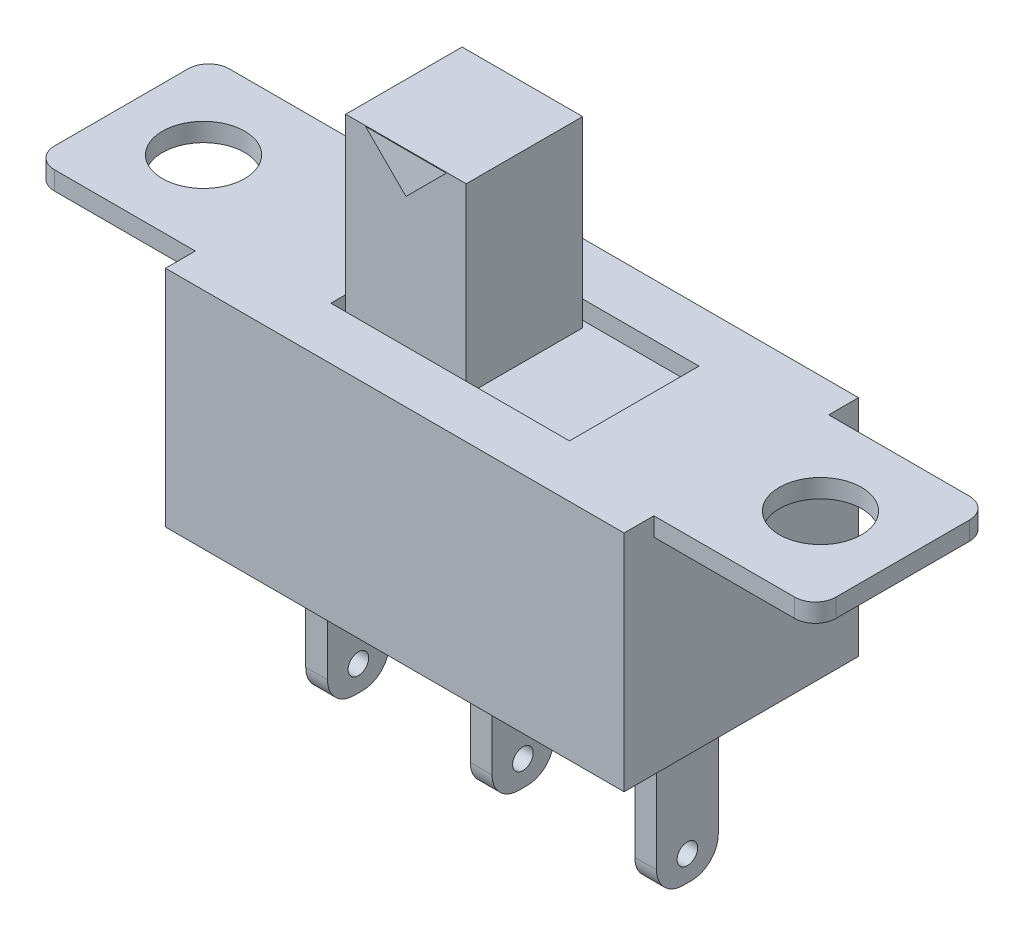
ISO-10303-21;
HEADER;
FILE_DESCRIPTION(('STEP AP214'),'2;1');
FILE_NAME('part.step','',(''),(''),'','','');
FILE_SCHEMA(('AUTOMOTIVE_DESIGN { 1 0 10303 214 1 1 1 1 }'));
ENDSEC;
DATA;
#1=APPLICATION_CONTEXT('core data for automotive mechanical design processes');
#2=APPLICATION_PROTOCOL_DEFINITION('international standard','automotive_design',2000,#1);
#3=PRODUCT_CONTEXT('',#1,'mechanical');
#4=PRODUCT('Part','Part','',(#3));
#5=PRODUCT_RELATED_PRODUCT_CATEGORY('part','',(#4));
#6=PRODUCT_DEFINITION_FORMATION('','',#4);
#7=PRODUCT_DEFINITION_CONTEXT('part definition',#1,'design');
#8=PRODUCT_DEFINITION('design','',#6,#7);
#9=PRODUCT_DEFINITION_SHAPE('','',#8);
#10=(LENGTH_UNIT() NAMED_UNIT(*) SI_UNIT(.MILLI.,.METRE.));
#11=(NAMED_UNIT(*) PLANE_ANGLE_UNIT() SI_UNIT($,.RADIAN.));
#12=(NAMED_UNIT(*) SI_UNIT($,.STERADIAN.) SOLID_ANGLE_UNIT());
#13=UNCERTAINTY_MEASURE_WITH_UNIT(LENGTH_MEASURE(1.E-05),#10,'distance_accuracy_value','');
#14=(GEOMETRIC_REPRESENTATION_CONTEXT(3) GLOBAL_UNCERTAINTY_ASSIGNED_CONTEXT((#13)) GLOBAL_UNIT_ASSIGNED_CONTEXT((#10,
#11,#12)) REPRESENTATION_CONTEXT('',''));
#15=CARTESIAN_POINT('',(0.,0.,0.));
#16=DIRECTION('',(0.,0.,1.));
#17=DIRECTION('',(1.,0.,0.));
#18=AXIS2_PLACEMENT_3D('',#15,#16,#17);
#19=CARTESIAN_POINT('',(14.2184363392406,0.,-0.527312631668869));
#20=DIRECTION('',(0.,1.,0.));
#21=DIRECTION('',(0.,0.,1.));
#22=AXIS2_PLACEMENT_3D('',#19,#20,#21);
#23=PLANE('',#22);
#24=DIRECTION('',(0.,0.,-1.));
#25=VECTOR('',#24,1.);
#26=CARTESIAN_POINT('',(11.6151545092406,0.,-4.95231263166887));
#27=LINE('',#26,#25);
#28=CARTESIAN_POINT('',(11.6151545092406,0.,-1.80231263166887));
#29=VERTEX_POINT('',#28);
#30=CARTESIAN_POINT('',(11.6151545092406,0.,-4.95231263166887));
#31=VERTEX_POINT('',#30);
#32=EDGE_CURVE('E492',#29,#31,#27,.T.);
#33=ORIENTED_EDGE('',*,*,#32,.T.);
#34=DIRECTION('',(-1.,0.,0.));
#35=VECTOR('',#34,1.);
#36=CARTESIAN_POINT('',(5.81515450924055,0.,-4.95231263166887));
#37=LINE('',#36,#35);
#38=CARTESIAN_POINT('',(5.81515450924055,0.,-4.95231263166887));
#39=VERTEX_POINT('',#38);
#40=EDGE_CURVE('E495',#31,#39,#37,.T.);
#41=ORIENTED_EDGE('',*,*,#40,.T.);
#42=DIRECTION('',(0.,0.,1.));
#43=VECTOR('',#42,1.);
#44=CARTESIAN_POINT('',(5.81515450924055,0.,-4.95231263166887));
#45=LINE('',#44,#43);
#46=CARTESIAN_POINT('',(5.81515450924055,0.,-1.80231263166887));
#47=VERTEX_POINT('',#46);
#48=EDGE_CURVE('E486',#39,#47,#45,.T.);
#49=ORIENTED_EDGE('',*,*,#48,.T.);
#50=DIRECTION('',(1.,0.,0.));
#51=VECTOR('',#50,1.);
#52=CARTESIAN_POINT('',(5.81515450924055,0.,-1.80231263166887));
#53=LINE('',#52,#51);
#54=EDGE_CURVE('E489',#47,#29,#53,.T.);
#55=ORIENTED_EDGE('',*,*,#54,.T.);
#56=EDGE_LOOP('',(#33,#41,#49,#55));
#57=FACE_BOUND('',#56,.T.);
#58=DIRECTION('',(-1.,0.,0.));
#59=VECTOR('',#58,1.);
#60=CARTESIAN_POINT('',(8.94515450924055,0.,-4.79231263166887));
#61=LINE('',#60,#59);
#62=CARTESIAN_POINT('',(8.94515450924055,0.,-4.79231263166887));
#63=VERTEX_POINT('',#62);
#64=CARTESIAN_POINT('',(6.01515450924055,0.,-4.79231263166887));
#65=VERTEX_POINT('',#64);
#66=EDGE_CURVE('E352',#63,#65,#61,.T.);
#67=ORIENTED_EDGE('',*,*,#66,.F.);
#68=DIRECTION('',(0.,0.,-1.));
#69=VECTOR('',#68,1.);
#70=CARTESIAN_POINT('',(8.94515450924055,0.,-4.79231263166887));
#71=LINE('',#70,#69);
#72=CARTESIAN_POINT('',(8.94515450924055,0.,-1.96231263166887));
#73=VERTEX_POINT('',#72);
#74=EDGE_CURVE('E349',#73,#63,#71,.T.);
#75=ORIENTED_EDGE('',*,*,#74,.F.);
#76=DIRECTION('',(1.,0.,0.));
#77=VECTOR('',#76,1.);
#78=CARTESIAN_POINT('',(8.94515450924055,0.,-1.96231263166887));
#79=LINE('',#78,#77);
#80=CARTESIAN_POINT('',(6.01515450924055,0.,-1.96231263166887));
#81=VERTEX_POINT('',#80);
#82=EDGE_CURVE('E357',#81,#73,#79,.T.);
#83=ORIENTED_EDGE('',*,*,#82,.F.);
#84=DIRECTION('',(0.,0.,1.));
#85=VECTOR('',#84,1.);
#86=CARTESIAN_POINT('',(6.01515450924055,0.,-4.79231263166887));
#87=LINE('',#86,#85);
#88=EDGE_CURVE('E354',#65,#81,#87,.T.);
#89=ORIENTED_EDGE('',*,*,#88,.F.);
#90=EDGE_LOOP('',(#67,#75,#83,#89));
#91=FACE_BOUND('',#90,.T.);
#92=ADVANCED_FACE('F26',(#57,#91),#23,.T.);
#93=CARTESIAN_POINT('',(14.2184363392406,-5.,-0.527312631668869));
#94=DIRECTION('',(0.,1.,0.));
#95=DIRECTION('',(0.,0.,1.));
#96=AXIS2_PLACEMENT_3D('',#93,#94,#95);
#97=PLANE('',#96);
#98=DIRECTION('',(0.,0.,1.));
#99=VECTOR('',#98,1.);
#100=CARTESIAN_POINT('',(12.9084363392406,-5.,-2.62731263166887));
#101=LINE('',#100,#99);
#102=CARTESIAN_POINT('',(12.9084363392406,-5.,-4.12731263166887));
#103=VERTEX_POINT('',#102);
#104=CARTESIAN_POINT('',(12.9084363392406,-5.,-2.62731263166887));
#105=VERTEX_POINT('',#104);
#106=EDGE_CURVE('E422',#103,#105,#101,.T.);
#107=ORIENTED_EDGE('',*,*,#106,.F.);
#108=DIRECTION('',(1.,0.,0.));
#109=VECTOR('',#108,1.);
#110=CARTESIAN_POINT('',(12.9084363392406,-5.,-4.12731263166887));
#111=LINE('',#110,#109);
#112=CARTESIAN_POINT('',(12.3784363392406,-5.,-4.12731263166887));
#113=VERTEX_POINT('',#112);
#114=EDGE_CURVE('E431',#113,#103,#111,.T.);
#115=ORIENTED_EDGE('',*,*,#114,.F.);
#116=DIRECTION('',(0.,0.,-1.));
#117=VECTOR('',#116,1.);
#118=CARTESIAN_POINT('',(12.3784363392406,-5.,-2.62731263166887));
#119=LINE('',#118,#117);
#120=CARTESIAN_POINT('',(12.3784363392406,-5.,-2.62731263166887));
#121=VERTEX_POINT('',#120);
#122=EDGE_CURVE('E428',#121,#113,#119,.T.);
#123=ORIENTED_EDGE('',*,*,#122,.F.);
#124=DIRECTION('',(-1.,0.,0.));
#125=VECTOR('',#124,1.);
#126=CARTESIAN_POINT('',(12.9084363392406,-5.,-2.62731263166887));
#127=LINE('',#126,#125);
#128=EDGE_CURVE('E425',#105,#121,#127,.T.);
#129=ORIENTED_EDGE('',*,*,#128,.F.);
#130=EDGE_LOOP('',(#107,#115,#123,#129));
#131=FACE_BOUND('',#130,.T.);
#132=DIRECTION('',(0.,0.,1.));
#133=VECTOR('',#132,1.);
#134=CARTESIAN_POINT('',(14.2184363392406,-5.,-0.527312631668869));
#135=LINE('',#134,#133);
#136=CARTESIAN_POINT('',(14.2184363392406,-5.,-6.22731263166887));
#137=VERTEX_POINT('',#136);
#138=CARTESIAN_POINT('',(14.2184363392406,-5.,-0.527312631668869));
#139=VERTEX_POINT('',#138);
#140=EDGE_CURVE('E474',#137,#139,#135,.T.);
#141=ORIENTED_EDGE('',*,*,#140,.T.);
#142=DIRECTION('',(-1.,0.,0.));
#143=VECTOR('',#142,1.);
#144=CARTESIAN_POINT('',(14.2184363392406,-5.,-0.527312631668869));
#145=LINE('',#144,#143);
#146=CARTESIAN_POINT('',(3.06843633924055,-5.,-0.52731263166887));
#147=VERTEX_POINT('',#146);
#148=EDGE_CURVE('E477',#139,#147,#145,.T.);
#149=ORIENTED_EDGE('',*,*,#148,.T.);
#150=DIRECTION('',(0.,0.,-1.));
#151=VECTOR('',#150,1.);
#152=CARTESIAN_POINT('',(3.06843633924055,-5.,-0.52731263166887));
#153=LINE('',#152,#151);
#154=CARTESIAN_POINT('',(3.06843633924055,-5.,-6.22731263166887));
#155=VERTEX_POINT('',#154);
#156=EDGE_CURVE('E480',#147,#155,#153,.T.);
#157=ORIENTED_EDGE('',*,*,#156,.T.);
#158=DIRECTION('',(1.,0.,0.));
#159=VECTOR('',#158,1.);
#160=CARTESIAN_POINT('',(14.2184363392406,-5.,-6.22731263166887));
#161=LINE('',#160,#159);
#162=EDGE_CURVE('E483',#155,#137,#161,.T.);
#163=ORIENTED_EDGE('',*,*,#162,.T.);
#164=EDGE_LOOP('',(#141,#149,#157,#163));
#165=FACE_BOUND('',#164,.T.);
#166=DIRECTION('',(0.,0.,1.));
#167=VECTOR('',#166,1.);
#168=CARTESIAN_POINT('',(8.90843633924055,-5.,-2.62731263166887));
#169=LINE('',#168,#167);
#170=CARTESIAN_POINT('',(8.90843633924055,-5.,-4.12731263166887));
#171=VERTEX_POINT('',#170);
#172=CARTESIAN_POINT('',(8.90843633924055,-5.,-2.62731263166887));
#173=VERTEX_POINT('',#172);
#174=EDGE_CURVE('E448',#171,#173,#169,.T.);
#175=ORIENTED_EDGE('',*,*,#174,.F.);
#176=DIRECTION('',(1.,0.,0.));
#177=VECTOR('',#176,1.);
#178=CARTESIAN_POINT('',(8.90843633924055,-5.,-4.12731263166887));
#179=LINE('',#178,#177);
#180=CARTESIAN_POINT('',(8.37843633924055,-5.,-4.12731263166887));
#181=VERTEX_POINT('',#180);
#182=EDGE_CURVE('E457',#181,#171,#179,.T.);
#183=ORIENTED_EDGE('',*,*,#182,.F.);
#184=DIRECTION('',(0.,0.,-1.));
#185=VECTOR('',#184,1.);
#186=CARTESIAN_POINT('',(8.37843633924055,-5.,-2.62731263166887));
#187=LINE('',#186,#185);
#188=CARTESIAN_POINT('',(8.37843633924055,-5.,-2.62731263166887));
#189=VERTEX_POINT('',#188);
#190=EDGE_CURVE('E454',#189,#181,#187,.T.);
#191=ORIENTED_EDGE('',*,*,#190,.F.);
#192=DIRECTION('',(-1.,0.,0.));
#193=VECTOR('',#192,1.);
#194=CARTESIAN_POINT('',(8.90843633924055,-5.,-2.62731263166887));
#195=LINE('',#194,#193);
#196=EDGE_CURVE('E451',#173,#189,#195,.T.);
#197=ORIENTED_EDGE('',*,*,#196,.F.);
#198=EDGE_LOOP('',(#175,#183,#191,#197));
#199=FACE_BOUND('',#198,.T.);
#200=DIRECTION('',(0.,0.,1.));
#201=VECTOR('',#200,1.);
#202=CARTESIAN_POINT('',(4.90843633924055,-5.,-2.6273126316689));
#203=LINE('',#202,#201);
#204=CARTESIAN_POINT('',(4.90843633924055,-5.,-4.1273126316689));
#205=VERTEX_POINT('',#204);
#206=CARTESIAN_POINT('',(4.90843633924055,-5.,-2.6273126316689));
#207=VERTEX_POINT('',#206);
#208=EDGE_CURVE('E396',#205,#207,#203,.T.);
#209=ORIENTED_EDGE('',*,*,#208,.F.);
#210=DIRECTION('',(1.,0.,0.));
#211=VECTOR('',#210,1.);
#212=CARTESIAN_POINT('',(4.90843633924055,-5.,-4.1273126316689));
#213=LINE('',#212,#211);
#214=CARTESIAN_POINT('',(4.37843633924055,-5.,-4.1273126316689));
#215=VERTEX_POINT('',#214);
#216=EDGE_CURVE('E405',#215,#205,#213,.T.);
#217=ORIENTED_EDGE('',*,*,#216,.F.);
#218=DIRECTION('',(0.,0.,-1.));
#219=VECTOR('',#218,1.);
#220=CARTESIAN_POINT('',(4.37843633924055,-5.,-2.6273126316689));
#221=LINE('',#220,#219);
#222=CARTESIAN_POINT('',(4.37843633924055,-5.,-2.6273126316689));
#223=VERTEX_POINT('',#222);
#224=EDGE_CURVE('E402',#223,#215,#221,.T.);
#225=ORIENTED_EDGE('',*,*,#224,.F.);
#226=DIRECTION('',(-1.,0.,0.));
#227=VECTOR('',#226,1.);
#228=CARTESIAN_POINT('',(4.90843633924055,-5.,-2.6273126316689));
#229=LINE('',#228,#227);
#230=EDGE_CURVE('E399',#207,#223,#229,.T.);
#231=ORIENTED_EDGE('',*,*,#230,.F.);
#232=EDGE_LOOP('',(#209,#217,#225,#231));
#233=FACE_BOUND('',#232,.T.);
#234=ADVANCED_FACE('F774',(#131,#165,#199,#233),#97,.F.);
#235=CARTESIAN_POINT('',(3.06843633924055,0.,-5.50231263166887));
#236=DIRECTION('',(0.,-1.,0.));
#237=DIRECTION('',(0.,0.,-1.));
#238=AXIS2_PLACEMENT_3D('',#235,#236,#237);
#239=PLANE('',#238);
#240=DIRECTION('',(0.,0.,-1.));
#241=VECTOR('',#240,1.);
#242=CARTESIAN_POINT('',(18.1434363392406,0.,-1.25231263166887));
#243=LINE('',#242,#241);
#244=CARTESIAN_POINT('',(18.1434363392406,0.,-1.75231263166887));
#245=VERTEX_POINT('',#244);
#246=CARTESIAN_POINT('',(18.1434363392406,0.,-5.00231263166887));
#247=VERTEX_POINT('',#246);
#248=EDGE_CURVE('E535',#245,#247,#243,.T.);
#249=ORIENTED_EDGE('',*,*,#248,.F.);
#250=CARTESIAN_POINT('',(17.6434363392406,0.,-1.75231263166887));
#251=DIRECTION('',(0.,-1.,0.));
#252=DIRECTION('',(0.,0.,-1.));
#253=AXIS2_PLACEMENT_3D('',#250,#251,#252);
#254=CIRCLE('',#253,0.5);
#255=CARTESIAN_POINT('',(17.6434363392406,0.,-1.25231263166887));
#256=VERTEX_POINT('',#255);
#257=EDGE_CURVE('E602',#245,#256,#254,.T.);
#258=ORIENTED_EDGE('',*,*,#257,.T.);
#259=DIRECTION('',(1.,0.,0.));
#260=VECTOR('',#259,1.);
#261=CARTESIAN_POINT('',(14.2184363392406,0.,-1.25231263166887));
#262=LINE('',#261,#260);
#263=CARTESIAN_POINT('',(14.2184363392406,0.,-1.25231263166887));
#264=VERTEX_POINT('',#263);
#265=EDGE_CURVE('E539',#264,#256,#262,.T.);
#266=ORIENTED_EDGE('',*,*,#265,.F.);
#267=DIRECTION('',(0.,0.,1.));
#268=VECTOR('',#267,1.);
#269=CARTESIAN_POINT('',(14.2184363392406,0.,-0.527312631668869));
#270=LINE('',#269,#268);
#271=CARTESIAN_POINT('',(14.2184363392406,0.,-5.50231263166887));
#272=VERTEX_POINT('',#271);
#273=EDGE_CURVE('E585',#272,#264,#270,.T.);
#274=ORIENTED_EDGE('',*,*,#273,.F.);
#275=DIRECTION('',(-1.,0.,0.));
#276=VECTOR('',#275,1.);
#277=CARTESIAN_POINT('',(14.2184363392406,0.,-5.50231263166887));
#278=LINE('',#277,#276);
#279=CARTESIAN_POINT('',(17.6434363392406,0.,-5.50231263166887));
#280=VERTEX_POINT('',#279);
#281=EDGE_CURVE('E538',#280,#272,#278,.T.);
#282=ORIENTED_EDGE('',*,*,#281,.F.);
#283=CARTESIAN_POINT('',(17.6434363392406,0.,-5.00231263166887));
#284=DIRECTION('',(0.,-1.,0.));
#285=DIRECTION('',(0.,0.,-1.));
#286=AXIS2_PLACEMENT_3D('',#283,#284,#285);
#287=CIRCLE('',#286,0.5);
#288=EDGE_CURVE('E600',#280,#247,#287,.T.);
#289=ORIENTED_EDGE('',*,*,#288,.T.);
#290=EDGE_LOOP('',(#249,#258,#266,#274,#282,#289));
#291=FACE_BOUND('',#290,.T.);
#292=CARTESIAN_POINT('',(16.1434363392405,0.,-3.37731263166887));
#293=DIRECTION('',(0.,1.,0.));
#294=DIRECTION('',(0.,0.,1.));
#295=AXIS2_PLACEMENT_3D('',#292,#293,#294);
#296=CIRCLE('',#295,1.);
#297=CARTESIAN_POINT('',(16.1434363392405,0.,-2.37731263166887));
#298=VERTEX_POINT('',#297);
#299=EDGE_CURVE('E524',#298,#298,#296,.T.);
#300=ORIENTED_EDGE('',*,*,#299,.T.);
#301=EDGE_LOOP('',(#300));
#302=FACE_BOUND('',#301,.T.);
#303=ADVANCED_FACE('F698',(#291,#302),#239,.T.);
#304=CARTESIAN_POINT('',(3.06843633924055,0.45,-5.50231263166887));
#305=DIRECTION('',(0.,-1.,0.));
#306=DIRECTION('',(0.,0.,-1.));
#307=AXIS2_PLACEMENT_3D('',#304,#305,#306);
#308=PLANE('',#307);
#309=CARTESIAN_POINT('',(1.14343633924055,0.45,-3.37731263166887));
#310=DIRECTION('',(0.,1.,0.));
#311=DIRECTION('',(0.,0.,-1.));
#312=AXIS2_PLACEMENT_3D('',#309,#310,#311);
#313=CIRCLE('',#312,1.);
#314=CARTESIAN_POINT('',(1.14343633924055,0.45,-4.37731263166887));
#315=VERTEX_POINT('',#314);
#316=EDGE_CURVE('E521',#315,#315,#313,.T.);
#317=ORIENTED_EDGE('',*,*,#316,.F.);
#318=EDGE_LOOP('',(#317));
#319=FACE_BOUND('',#318,.T.);
#320=DIRECTION('',(1.,0.,0.));
#321=VECTOR('',#320,1.);
#322=CARTESIAN_POINT('',(14.2184363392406,0.45,-1.25231263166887));
#323=LINE('',#322,#321);
#324=CARTESIAN_POINT('',(14.2184363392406,0.45,-1.25231263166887));
#325=VERTEX_POINT('',#324);
#326=CARTESIAN_POINT('',(17.6434363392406,0.45,-1.25231263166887));
#327=VERTEX_POINT('',#326);
#328=EDGE_CURVE('E557',#325,#327,#323,.T.);
#329=ORIENTED_EDGE('',*,*,#328,.T.);
#330=CARTESIAN_POINT('',(17.6434363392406,0.45,-1.75231263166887));
#331=DIRECTION('',(0.,-1.,0.));
#332=DIRECTION('',(0.,0.,-1.));
#333=AXIS2_PLACEMENT_3D('',#330,#331,#332);
#334=CIRCLE('',#333,0.5);
#335=CARTESIAN_POINT('',(18.1434363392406,0.45,-1.75231263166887));
#336=VERTEX_POINT('',#335);
#337=EDGE_CURVE('E612',#327,#336,#334,.F.);
#338=ORIENTED_EDGE('',*,*,#337,.T.);
#339=DIRECTION('',(0.,0.,-1.));
#340=VECTOR('',#339,1.);
#341=CARTESIAN_POINT('',(18.1434363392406,0.45,-1.25231263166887));
#342=LINE('',#341,#340);
#343=CARTESIAN_POINT('',(18.1434363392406,0.45,-5.00231263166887));
#344=VERTEX_POINT('',#343);
#345=EDGE_CURVE('E560',#336,#344,#342,.T.);
#346=ORIENTED_EDGE('',*,*,#345,.T.);
#347=CARTESIAN_POINT('',(17.6434363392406,0.45,-5.00231263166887));
#348=DIRECTION('',(0.,-1.,0.));
#349=DIRECTION('',(0.,0.,-1.));
#350=AXIS2_PLACEMENT_3D('',#347,#348,#349);
#351=CIRCLE('',#350,0.5);
#352=CARTESIAN_POINT('',(17.6434363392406,0.45,-5.50231263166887));
#353=VERTEX_POINT('',#352);
#354=EDGE_CURVE('E610',#344,#353,#351,.F.);
#355=ORIENTED_EDGE('',*,*,#354,.T.);
#356=DIRECTION('',(-1.,0.,0.));
#357=VECTOR('',#356,1.);
#358=CARTESIAN_POINT('',(14.2184363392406,0.45,-5.50231263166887));
#359=LINE('',#358,#357);
#360=CARTESIAN_POINT('',(14.2184363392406,0.45,-5.50231263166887));
#361=VERTEX_POINT('',#360);
#362=EDGE_CURVE('E563',#353,#361,#359,.T.);
#363=ORIENTED_EDGE('',*,*,#362,.T.);
#364=DIRECTION('',(0.,0.,-1.));
#365=VECTOR('',#364,1.);
#366=CARTESIAN_POINT('',(14.2184363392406,0.45,-6.22731263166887));
#367=LINE('',#366,#365);
#368=CARTESIAN_POINT('',(14.2184363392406,0.45,-6.22731263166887));
#369=VERTEX_POINT('',#368);
#370=EDGE_CURVE('E565',#361,#369,#367,.T.);
#371=ORIENTED_EDGE('',*,*,#370,.T.);
#372=DIRECTION('',(-1.,0.,0.));
#373=VECTOR('',#372,1.);
#374=CARTESIAN_POINT('',(3.06843633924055,0.45,-6.22731263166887));
#375=LINE('',#374,#373);
#376=CARTESIAN_POINT('',(3.06843633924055,0.45,-6.22731263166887));
#377=VERTEX_POINT('',#376);
#378=EDGE_CURVE('E567',#369,#377,#375,.T.);
#379=ORIENTED_EDGE('',*,*,#378,.T.);
#380=DIRECTION('',(0.,0.,1.));
#381=VECTOR('',#380,1.);
#382=CARTESIAN_POINT('',(3.06843633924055,0.45,-6.22731263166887));
#383=LINE('',#382,#381);
#384=CARTESIAN_POINT('',(3.06843633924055,0.45,-5.50231263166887));
#385=VERTEX_POINT('',#384);
#386=EDGE_CURVE('E540',#377,#385,#383,.T.);
#387=ORIENTED_EDGE('',*,*,#386,.T.);
#388=DIRECTION('',(-1.,0.,0.));
#389=VECTOR('',#388,1.);
#390=CARTESIAN_POINT('',(3.06843633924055,0.45,-5.50231263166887));
#391=LINE('',#390,#389);
#392=CARTESIAN_POINT('',(-0.356563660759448,0.45,-5.50231263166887));
#393=VERTEX_POINT('',#392);
#394=EDGE_CURVE('E543',#385,#393,#391,.T.);
#395=ORIENTED_EDGE('',*,*,#394,.T.);
#396=CARTESIAN_POINT('',(-0.356563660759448,0.45,-5.00231263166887));
#397=DIRECTION('',(0.,-1.,0.));
#398=DIRECTION('',(0.,0.,-1.));
#399=AXIS2_PLACEMENT_3D('',#396,#397,#398);
#400=CIRCLE('',#399,0.5);
#401=CARTESIAN_POINT('',(-0.856563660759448,0.45,-5.00231263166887));
#402=VERTEX_POINT('',#401);
#403=EDGE_CURVE('E608',#393,#402,#400,.F.);
#404=ORIENTED_EDGE('',*,*,#403,.T.);
#405=DIRECTION('',(0.,0.,1.));
#406=VECTOR('',#405,1.);
#407=CARTESIAN_POINT('',(-0.856563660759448,0.45,-1.25231263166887));
#408=LINE('',#407,#406);
#409=CARTESIAN_POINT('',(-0.856563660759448,0.45,-1.75231263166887));
#410=VERTEX_POINT('',#409);
#411=EDGE_CURVE('E546',#402,#410,#408,.T.);
#412=ORIENTED_EDGE('',*,*,#411,.T.);
#413=CARTESIAN_POINT('',(-0.356563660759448,0.45,-1.75231263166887));
#414=DIRECTION('',(0.,-1.,0.));
#415=DIRECTION('',(0.,0.,-1.));
#416=AXIS2_PLACEMENT_3D('',#413,#414,#415);
#417=CIRCLE('',#416,0.5);
#418=CARTESIAN_POINT('',(-0.356563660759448,0.45,-1.25231263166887));
#419=VERTEX_POINT('',#418);
#420=EDGE_CURVE('E606',#410,#419,#417,.F.);
#421=ORIENTED_EDGE('',*,*,#420,.T.);
#422=DIRECTION('',(1.,0.,0.));
#423=VECTOR('',#422,1.);
#424=CARTESIAN_POINT('',(3.06843633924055,0.45,-1.25231263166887));
#425=LINE('',#424,#423);
#426=CARTESIAN_POINT('',(3.06843633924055,0.45,-1.25231263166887));
#427=VERTEX_POINT('',#426);
#428=EDGE_CURVE('E549',#419,#427,#425,.T.);
#429=ORIENTED_EDGE('',*,*,#428,.T.);
#430=DIRECTION('',(0.,0.,1.));
#431=VECTOR('',#430,1.);
#432=CARTESIAN_POINT('',(3.06843633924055,0.45,-0.527312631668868));
#433=LINE('',#432,#431);
#434=CARTESIAN_POINT('',(3.06843633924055,0.45,-0.527312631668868));
#435=VERTEX_POINT('',#434);
#436=EDGE_CURVE('E551',#427,#435,#433,.T.);
#437=ORIENTED_EDGE('',*,*,#436,.T.);
#438=DIRECTION('',(1.,0.,0.));
#439=VECTOR('',#438,1.);
#440=CARTESIAN_POINT('',(3.06843633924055,0.45,-0.527312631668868));
#441=LINE('',#440,#439);
#442=CARTESIAN_POINT('',(14.2184363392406,0.45,-0.527312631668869));
#443=VERTEX_POINT('',#442);
#444=EDGE_CURVE('E553',#435,#443,#441,.T.);
#445=ORIENTED_EDGE('',*,*,#444,.T.);
#446=DIRECTION('',(0.,0.,-1.));
#447=VECTOR('',#446,1.);
#448=CARTESIAN_POINT('',(14.2184363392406,0.45,-0.527312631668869));
#449=LINE('',#448,#447);
#450=EDGE_CURVE('E555',#443,#325,#449,.T.);
#451=ORIENTED_EDGE('',*,*,#450,.T.);
#452=EDGE_LOOP('',(#329,#338,#346,#355,#363,#371,#379,#387,#395,#404,#412,#421,#429,#437,#445,#451));
#453=FACE_BOUND('',#452,.T.);
#454=CARTESIAN_POINT('',(16.1434363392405,0.45,-3.37731263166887));
#455=DIRECTION('',(0.,1.,0.));
#456=DIRECTION('',(0.,0.,1.));
#457=AXIS2_PLACEMENT_3D('',#454,#455,#456);
#458=CIRCLE('',#457,1.);
#459=CARTESIAN_POINT('',(16.1434363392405,0.45,-2.37731263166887));
#460=VERTEX_POINT('',#459);
#461=EDGE_CURVE('E527',#460,#460,#458,.T.);
#462=ORIENTED_EDGE('',*,*,#461,.F.);
#463=EDGE_LOOP('',(#462));
#464=FACE_BOUND('',#463,.T.);
#465=DIRECTION('',(0.,0.,1.));
#466=VECTOR('',#465,1.);
#467=CARTESIAN_POINT('',(5.81515450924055,0.45,-4.95231263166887));
#468=LINE('',#467,#466);
#469=CARTESIAN_POINT('',(5.81515450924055,0.45,-4.95231263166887));
#470=VERTEX_POINT('',#469);
#471=CARTESIAN_POINT('',(5.81515450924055,0.45,-1.80231263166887));
#472=VERTEX_POINT('',#471);
#473=EDGE_CURVE('E498',#470,#472,#468,.T.);
#474=ORIENTED_EDGE('',*,*,#473,.F.);
#475=DIRECTION('',(-1.,0.,0.));
#476=VECTOR('',#475,1.);
#477=CARTESIAN_POINT('',(5.81515450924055,0.45,-4.95231263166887));
#478=LINE('',#477,#476);
#479=CARTESIAN_POINT('',(11.6151545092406,0.45,-4.95231263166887));
#480=VERTEX_POINT('',#479);
#481=EDGE_CURVE('E505',#480,#470,#478,.T.);
#482=ORIENTED_EDGE('',*,*,#481,.F.);
#483=DIRECTION('',(0.,0.,-1.));
#484=VECTOR('',#483,1.);
#485=CARTESIAN_POINT('',(11.6151545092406,0.45,-4.95231263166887));
#486=LINE('',#485,#484);
#487=CARTESIAN_POINT('',(11.6151545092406,0.45,-1.80231263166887));
#488=VERTEX_POINT('',#487);
#489=EDGE_CURVE('E502',#488,#480,#486,.T.);
#490=ORIENTED_EDGE('',*,*,#489,.F.);
#491=DIRECTION('',(1.,0.,0.));
#492=VECTOR('',#491,1.);
#493=CARTESIAN_POINT('',(5.81515450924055,0.45,-1.80231263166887));
#494=LINE('',#493,#492);
#495=EDGE_CURVE('E500',#472,#488,#494,.T.);
#496=ORIENTED_EDGE('',*,*,#495,.F.);
#497=EDGE_LOOP('',(#474,#482,#490,#496));
#498=FACE_BOUND('',#497,.T.);
#499=ADVANCED_FACE('F715',(#319,#453,#464,#498),#308,.F.);
#500=DIRECTION('',(0.,0.,1.));
#501=VECTOR('',#500,1.);
#502=CARTESIAN_POINT('',(-0.856563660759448,0.,-1.25231263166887));
#503=LINE('',#502,#501);
#504=CARTESIAN_POINT('',(-0.856563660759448,0.,-5.00231263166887));
#505=VERTEX_POINT('',#504);
#506=CARTESIAN_POINT('',(-0.856563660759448,0.,-1.75231263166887));
#507=VERTEX_POINT('',#506);
#508=EDGE_CURVE('E531',#505,#507,#503,.T.);
#509=ORIENTED_EDGE('',*,*,#508,.F.);
#510=CARTESIAN_POINT('',(-0.356563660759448,0.,-5.00231263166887));
#511=DIRECTION('',(0.,-1.,0.));
#512=DIRECTION('',(0.,0.,-1.));
#513=AXIS2_PLACEMENT_3D('',#510,#511,#512);
#514=CIRCLE('',#513,0.5);
#515=CARTESIAN_POINT('',(-0.356563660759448,0.,-5.50231263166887));
#516=VERTEX_POINT('',#515);
#517=EDGE_CURVE('E41',#505,#516,#514,.T.);
#518=ORIENTED_EDGE('',*,*,#517,.T.);
#519=DIRECTION('',(-1.,0.,0.));
#520=VECTOR('',#519,1.);
#521=CARTESIAN_POINT('',(3.06843633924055,0.,-5.50231263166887));
#522=LINE('',#521,#520);
#523=CARTESIAN_POINT('',(3.06843633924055,0.,-5.50231263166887));
#524=VERTEX_POINT('',#523);
#525=EDGE_CURVE('E530',#524,#516,#522,.T.);
#526=ORIENTED_EDGE('',*,*,#525,.F.);
#527=DIRECTION('',(0.,0.,-1.));
#528=VECTOR('',#527,1.);
#529=CARTESIAN_POINT('',(3.06843633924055,0.,-0.52731263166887));
#530=LINE('',#529,#528);
#531=CARTESIAN_POINT('',(3.06843633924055,0.,-1.25231263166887));
#532=VERTEX_POINT('',#531);
#533=EDGE_CURVE('E589',#532,#524,#530,.T.);
#534=ORIENTED_EDGE('',*,*,#533,.F.);
#535=DIRECTION('',(1.,0.,0.));
#536=VECTOR('',#535,1.);
#537=CARTESIAN_POINT('',(3.06843633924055,0.,-1.25231263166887));
#538=LINE('',#537,#536);
#539=CARTESIAN_POINT('',(-0.356563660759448,0.,-1.25231263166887));
#540=VERTEX_POINT('',#539);
#541=EDGE_CURVE('E534',#540,#532,#538,.T.);
#542=ORIENTED_EDGE('',*,*,#541,.F.);
#543=CARTESIAN_POINT('',(-0.356563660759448,0.,-1.75231263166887));
#544=DIRECTION('',(0.,-1.,0.));
#545=DIRECTION('',(0.,0.,-1.));
#546=AXIS2_PLACEMENT_3D('',#543,#544,#545);
#547=CIRCLE('',#546,0.5);
#548=EDGE_CURVE('E49',#540,#507,#547,.T.);
#549=ORIENTED_EDGE('',*,*,#548,.T.);
#550=EDGE_LOOP('',(#509,#518,#526,#534,#542,#549));
#551=FACE_BOUND('',#550,.T.);
#552=CARTESIAN_POINT('',(1.14343633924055,0.,-3.37731263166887));
#553=DIRECTION('',(0.,1.,0.));
#554=DIRECTION('',(0.,0.,-1.));
#555=AXIS2_PLACEMENT_3D('',#552,#553,#554);
#556=CIRCLE('',#555,1.);
#557=CARTESIAN_POINT('',(1.14343633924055,0.,-4.37731263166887));
#558=VERTEX_POINT('',#557);
#559=EDGE_CURVE('E518',#558,#558,#556,.T.);
#560=ORIENTED_EDGE('',*,*,#559,.T.);
#561=EDGE_LOOP('',(#560));
#562=FACE_BOUND('',#561,.T.);
#563=ADVANCED_FACE('F753',(#551,#562),#239,.T.);
#564=CARTESIAN_POINT('',(3.06843633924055,0.45,-5.50231263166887));
#565=DIRECTION('',(0.,0.,1.));
#566=DIRECTION('',(1.,0.,0.));
#567=AXIS2_PLACEMENT_3D('',#564,#565,#566);
#568=PLANE('',#567);
#569=ORIENTED_EDGE('',*,*,#525,.T.);
#570=DIRECTION('',(0.,-1.,0.));
#571=VECTOR('',#570,1.);
#572=CARTESIAN_POINT('',(-0.356563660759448,0.45,-5.50231263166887));
#573=LINE('',#572,#571);
#574=EDGE_CURVE('E34',#516,#393,#573,.F.);
#575=ORIENTED_EDGE('',*,*,#574,.T.);
#576=ORIENTED_EDGE('',*,*,#394,.F.);
#577=DIRECTION('',(0.,-1.,0.));
#578=VECTOR('',#577,1.);
#579=CARTESIAN_POINT('',(3.06843633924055,0.45,-5.50231263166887));
#580=LINE('',#579,#578);
#581=EDGE_CURVE('E632',#385,#524,#580,.T.);
#582=ORIENTED_EDGE('',*,*,#581,.T.);
#583=EDGE_LOOP('',(#569,#575,#576,#582));
#584=FACE_BOUND('',#583,.T.);
#585=ADVANCED_FACE('F28',(#584),#568,.F.);
#586=CARTESIAN_POINT('',(-0.856563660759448,0.45,-1.25231263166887));
#587=DIRECTION('',(1.,0.,0.));
#588=DIRECTION('',(0.,0.,-1.));
#589=AXIS2_PLACEMENT_3D('',#586,#587,#588);
#590=PLANE('',#589);
#591=ORIENTED_EDGE('',*,*,#411,.F.);
#592=DIRECTION('',(0.,-1.,0.));
#593=VECTOR('',#592,1.);
#594=CARTESIAN_POINT('',(-0.856563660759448,0.45,-5.00231263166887));
#595=LINE('',#594,#593);
#596=EDGE_CURVE('E619',#402,#505,#595,.T.);
#597=ORIENTED_EDGE('',*,*,#596,.T.);
#598=ORIENTED_EDGE('',*,*,#508,.T.);
#599=DIRECTION('',(0.,-1.,0.));
#600=VECTOR('',#599,1.);
#601=CARTESIAN_POINT('',(-0.856563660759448,0.45,-1.75231263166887));
#602=LINE('',#601,#600);
#603=EDGE_CURVE('E617',#507,#410,#602,.F.);
#604=ORIENTED_EDGE('',*,*,#603,.T.);
#605=EDGE_LOOP('',(#591,#597,#598,#604));
#606=FACE_BOUND('',#605,.T.);
#607=ADVANCED_FACE('F757',(#606),#590,.F.);
#608=CARTESIAN_POINT('',(3.06843633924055,0.45,-1.25231263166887));
#609=DIRECTION('',(0.,0.,-1.));
#610=DIRECTION('',(-1.,0.,0.));
#611=AXIS2_PLACEMENT_3D('',#608,#609,#610);
#612=PLANE('',#611);
#613=ORIENTED_EDGE('',*,*,#428,.F.);
#614=DIRECTION('',(0.,-1.,0.));
#615=VECTOR('',#614,1.);
#616=CARTESIAN_POINT('',(-0.356563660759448,0.45,-1.25231263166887));
#617=LINE('',#616,#615);
#618=EDGE_CURVE('E11',#419,#540,#617,.T.);
#619=ORIENTED_EDGE('',*,*,#618,.T.);
#620=ORIENTED_EDGE('',*,*,#541,.T.);
#621=DIRECTION('',(0.,-1.,0.));
#622=VECTOR('',#621,1.);
#623=CARTESIAN_POINT('',(3.06843633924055,0.45,-1.25231263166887));
#624=LINE('',#623,#622);
#625=EDGE_CURVE('E579',#427,#532,#624,.T.);
#626=ORIENTED_EDGE('',*,*,#625,.F.);
#627=EDGE_LOOP('',(#613,#619,#620,#626));
#628=FACE_BOUND('',#627,.T.);
#629=ADVANCED_FACE('F763',(#628),#612,.F.);
#630=CARTESIAN_POINT('',(3.06843633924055,0.45,-0.527312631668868));
#631=DIRECTION('',(1.,0.,0.));
#632=DIRECTION('',(0.,0.,-1.));
#633=AXIS2_PLACEMENT_3D('',#630,#631,#632);
#634=PLANE('',#633);
#635=ORIENTED_EDGE('',*,*,#625,.T.);
#636=ORIENTED_EDGE('',*,*,#533,.T.);
#637=ORIENTED_EDGE('',*,*,#581,.F.);
#638=ORIENTED_EDGE('',*,*,#386,.F.);
#639=DIRECTION('',(0.,-1.,0.));
#640=VECTOR('',#639,1.);
#641=CARTESIAN_POINT('',(3.06843633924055,0.45,-6.22731263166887));
#642=LINE('',#641,#640);
#643=EDGE_CURVE('E569',#377,#155,#642,.T.);
#644=ORIENTED_EDGE('',*,*,#643,.T.);
#645=ORIENTED_EDGE('',*,*,#156,.F.);
#646=DIRECTION('',(0.,-1.,0.));
#647=VECTOR('',#646,1.);
#648=CARTESIAN_POINT('',(3.06843633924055,0.45,-0.527312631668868));
#649=LINE('',#648,#647);
#650=EDGE_CURVE('E576',#435,#147,#649,.T.);
#651=ORIENTED_EDGE('',*,*,#650,.F.);
#652=ORIENTED_EDGE('',*,*,#436,.F.);
#653=EDGE_LOOP('',(#635,#636,#637,#638,#644,#645,#651,#652));
#654=FACE_BOUND('',#653,.T.);
#655=ADVANCED_FACE('F742',(#654),#634,.F.);
#656=CARTESIAN_POINT('',(3.06843633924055,0.45,-0.527312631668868));
#657=DIRECTION('',(0.,0.,-1.));
#658=DIRECTION('',(-1.,0.,0.));
#659=AXIS2_PLACEMENT_3D('',#656,#657,#658);
#660=PLANE('',#659);
#661=ORIENTED_EDGE('',*,*,#650,.T.);
#662=ORIENTED_EDGE('',*,*,#148,.F.);
#663=DIRECTION('',(0.,-1.,0.));
#664=VECTOR('',#663,1.);
#665=CARTESIAN_POINT('',(14.2184363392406,0.45,-0.527312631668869));
#666=LINE('',#665,#664);
#667=EDGE_CURVE('E574',#443,#139,#666,.T.);
#668=ORIENTED_EDGE('',*,*,#667,.F.);
#669=ORIENTED_EDGE('',*,*,#444,.F.);
#670=EDGE_LOOP('',(#661,#662,#668,#669));
#671=FACE_BOUND('',#670,.T.);
#672=ADVANCED_FACE('F772',(#671),#660,.F.);
#673=CARTESIAN_POINT('',(14.2184363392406,0.45,-1.25231263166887));
#674=DIRECTION('',(0.,0.,-1.));
#675=DIRECTION('',(-1.,0.,0.));
#676=AXIS2_PLACEMENT_3D('',#673,#674,#675);
#677=PLANE('',#676);
#678=ORIENTED_EDGE('',*,*,#265,.T.);
#679=DIRECTION('',(0.,-1.,0.));
#680=VECTOR('',#679,1.);
#681=CARTESIAN_POINT('',(17.6434363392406,0.45,-1.25231263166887));
#682=LINE('',#681,#680);
#683=EDGE_CURVE('E604',#256,#327,#682,.F.);
#684=ORIENTED_EDGE('',*,*,#683,.T.);
#685=ORIENTED_EDGE('',*,*,#328,.F.);
#686=DIRECTION('',(0.,-1.,0.));
#687=VECTOR('',#686,1.);
#688=CARTESIAN_POINT('',(14.2184363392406,0.45,-1.25231263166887));
#689=LINE('',#688,#687);
#690=EDGE_CURVE('E577',#325,#264,#689,.T.);
#691=ORIENTED_EDGE('',*,*,#690,.T.);
#692=EDGE_LOOP('',(#678,#684,#685,#691));
#693=FACE_BOUND('',#692,.T.);
#694=ADVANCED_FACE('F722',(#693),#677,.F.);
#695=CARTESIAN_POINT('',(18.1434363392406,0.45,-1.25231263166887));
#696=DIRECTION('',(-1.,0.,0.));
#697=DIRECTION('',(0.,0.,1.));
#698=AXIS2_PLACEMENT_3D('',#695,#696,#697);
#699=PLANE('',#698);
#700=ORIENTED_EDGE('',*,*,#345,.F.);
#701=DIRECTION('',(0.,-1.,0.));
#702=VECTOR('',#701,1.);
#703=CARTESIAN_POINT('',(18.1434363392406,0.45,-1.75231263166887));
#704=LINE('',#703,#702);
#705=EDGE_CURVE('E598',#336,#245,#704,.T.);
#706=ORIENTED_EDGE('',*,*,#705,.T.);
#707=ORIENTED_EDGE('',*,*,#248,.T.);
#708=DIRECTION('',(0.,-1.,0.));
#709=VECTOR('',#708,1.);
#710=CARTESIAN_POINT('',(18.1434363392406,0.45,-5.00231263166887));
#711=LINE('',#710,#709);
#712=EDGE_CURVE('E687',#247,#344,#711,.F.);
#713=ORIENTED_EDGE('',*,*,#712,.T.);
#714=EDGE_LOOP('',(#700,#706,#707,#713));
#715=FACE_BOUND('',#714,.T.);
#716=ADVANCED_FACE('F694',(#715),#699,.F.);
#717=CARTESIAN_POINT('',(14.2184363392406,0.45,-5.50231263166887));
#718=DIRECTION('',(0.,0.,1.));
#719=DIRECTION('',(1.,0.,0.));
#720=AXIS2_PLACEMENT_3D('',#717,#718,#719);
#721=PLANE('',#720);
#722=ORIENTED_EDGE('',*,*,#362,.F.);
#723=DIRECTION('',(0.,-1.,0.));
#724=VECTOR('',#723,1.);
#725=CARTESIAN_POINT('',(17.6434363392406,0.45,-5.50231263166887));
#726=LINE('',#725,#724);
#727=EDGE_CURVE('E614',#353,#280,#726,.T.);
#728=ORIENTED_EDGE('',*,*,#727,.T.);
#729=ORIENTED_EDGE('',*,*,#281,.T.);
#730=DIRECTION('',(0.,-1.,0.));
#731=VECTOR('',#730,1.);
#732=CARTESIAN_POINT('',(14.2184363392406,0.45,-5.50231263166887));
#733=LINE('',#732,#731);
#734=EDGE_CURVE('E573',#361,#272,#733,.T.);
#735=ORIENTED_EDGE('',*,*,#734,.F.);
#736=EDGE_LOOP('',(#722,#728,#729,#735));
#737=FACE_BOUND('',#736,.T.);
#738=ADVANCED_FACE('F710',(#737),#721,.F.);
#739=CARTESIAN_POINT('',(14.2184363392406,0.45,-6.22731263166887));
#740=DIRECTION('',(-1.,0.,0.));
#741=DIRECTION('',(0.,0.,1.));
#742=AXIS2_PLACEMENT_3D('',#739,#740,#741);
#743=PLANE('',#742);
#744=ORIENTED_EDGE('',*,*,#734,.T.);
#745=ORIENTED_EDGE('',*,*,#273,.T.);
#746=ORIENTED_EDGE('',*,*,#690,.F.);
#747=ORIENTED_EDGE('',*,*,#450,.F.);
#748=ORIENTED_EDGE('',*,*,#667,.T.);
#749=ORIENTED_EDGE('',*,*,#140,.F.);
#750=DIRECTION('',(0.,-1.,0.));
#751=VECTOR('',#750,1.);
#752=CARTESIAN_POINT('',(14.2184363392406,0.45,-6.22731263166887));
#753=LINE('',#752,#751);
#754=EDGE_CURVE('E571',#369,#137,#753,.T.);
#755=ORIENTED_EDGE('',*,*,#754,.F.);
#756=ORIENTED_EDGE('',*,*,#370,.F.);
#757=EDGE_LOOP('',(#744,#745,#746,#747,#748,#749,#755,#756));
#758=FACE_BOUND('',#757,.T.);
#759=ADVANCED_FACE('F730',(#758),#743,.F.);
#760=CARTESIAN_POINT('',(3.06843633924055,0.45,-6.22731263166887));
#761=DIRECTION('',(0.,0.,1.));
#762=DIRECTION('',(1.,0.,0.));
#763=AXIS2_PLACEMENT_3D('',#760,#761,#762);
#764=PLANE('',#763);
#765=ORIENTED_EDGE('',*,*,#754,.T.);
#766=ORIENTED_EDGE('',*,*,#162,.F.);
#767=ORIENTED_EDGE('',*,*,#643,.F.);
#768=ORIENTED_EDGE('',*,*,#378,.F.);
#769=EDGE_LOOP('',(#765,#766,#767,#768));
#770=FACE_BOUND('',#769,.T.);
#771=ADVANCED_FACE('F736',(#770),#764,.F.);
#772=CARTESIAN_POINT('',(16.1434363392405,0.45,-3.37731263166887));
#773=DIRECTION('',(0.,-1.,0.));
#774=DIRECTION('',(0.,0.,-1.));
#775=AXIS2_PLACEMENT_3D('',#772,#773,#774);
#776=CYLINDRICAL_SURFACE('',#775,1.);
#777=ORIENTED_EDGE('',*,*,#461,.T.);
#778=EDGE_LOOP('',(#777));
#779=FACE_BOUND('',#778,.T.);
#780=ORIENTED_EDGE('',*,*,#299,.F.);
#781=EDGE_LOOP('',(#780));
#782=FACE_BOUND('',#781,.T.);
#783=ADVANCED_FACE('F857',(#779,#782),#776,.F.);
#784=CARTESIAN_POINT('',(1.14343633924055,0.45,-3.37731263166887));
#785=DIRECTION('',(0.,-1.,0.));
#786=DIRECTION('',(0.,0.,-1.));
#787=AXIS2_PLACEMENT_3D('',#784,#785,#786);
#788=CYLINDRICAL_SURFACE('',#787,1.);
#789=ORIENTED_EDGE('',*,*,#316,.T.);
#790=EDGE_LOOP('',(#789));
#791=FACE_BOUND('',#790,.T.);
#792=ORIENTED_EDGE('',*,*,#559,.F.);
#793=EDGE_LOOP('',(#792));
#794=FACE_BOUND('',#793,.T.);
#795=ADVANCED_FACE('F853',(#791,#794),#788,.F.);
#796=CARTESIAN_POINT('',(5.81515450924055,0.45,-4.95231263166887));
#797=DIRECTION('',(1.,0.,0.));
#798=DIRECTION('',(0.,0.,-1.));
#799=AXIS2_PLACEMENT_3D('',#796,#797,#798);
#800=PLANE('',#799);
#801=ORIENTED_EDGE('',*,*,#48,.F.);
#802=DIRECTION('',(0.,-1.,0.));
#803=VECTOR('',#802,1.);
#804=CARTESIAN_POINT('',(5.81515450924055,0.45,-4.95231263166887));
#805=LINE('',#804,#803);
#806=EDGE_CURVE('E507',#470,#39,#805,.T.);
#807=ORIENTED_EDGE('',*,*,#806,.F.);
#808=ORIENTED_EDGE('',*,*,#473,.T.);
#809=DIRECTION('',(0.,-1.,0.));
#810=VECTOR('',#809,1.);
#811=CARTESIAN_POINT('',(5.81515450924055,0.45,-1.80231263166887));
#812=LINE('',#811,#810);
#813=EDGE_CURVE('E515',#472,#47,#812,.T.);
#814=ORIENTED_EDGE('',*,*,#813,.T.);
#815=EDGE_LOOP('',(#801,#807,#808,#814));
#816=FACE_BOUND('',#815,.T.);
#817=ADVANCED_FACE('F849',(#816),#800,.T.);
#818=CARTESIAN_POINT('',(5.81515450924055,0.45,-1.80231263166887));
#819=DIRECTION('',(0.,0.,-1.));
#820=DIRECTION('',(-1.,0.,0.));
#821=AXIS2_PLACEMENT_3D('',#818,#819,#820);
#822=PLANE('',#821);
#823=ORIENTED_EDGE('',*,*,#54,.F.);
#824=ORIENTED_EDGE('',*,*,#813,.F.);
#825=ORIENTED_EDGE('',*,*,#495,.T.);
#826=DIRECTION('',(0.,-1.,0.));
#827=VECTOR('',#826,1.);
#828=CARTESIAN_POINT('',(11.6151545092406,0.45,-1.80231263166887));
#829=LINE('',#828,#827);
#830=EDGE_CURVE('E513',#488,#29,#829,.T.);
#831=ORIENTED_EDGE('',*,*,#830,.T.);
#832=EDGE_LOOP('',(#823,#824,#825,#831));
#833=FACE_BOUND('',#832,.T.);
#834=ADVANCED_FACE('F845',(#833),#822,.T.);
#835=CARTESIAN_POINT('',(11.6151545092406,0.45,-4.95231263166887));
#836=DIRECTION('',(-1.,0.,0.));
#837=DIRECTION('',(0.,0.,1.));
#838=AXIS2_PLACEMENT_3D('',#835,#836,#837);
#839=PLANE('',#838);
#840=ORIENTED_EDGE('',*,*,#32,.F.);
#841=ORIENTED_EDGE('',*,*,#830,.F.);
#842=ORIENTED_EDGE('',*,*,#489,.T.);
#843=DIRECTION('',(0.,-1.,0.));
#844=VECTOR('',#843,1.);
#845=CARTESIAN_POINT('',(11.6151545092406,0.45,-4.95231263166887));
#846=LINE('',#845,#844);
#847=EDGE_CURVE('E510',#480,#31,#846,.T.);
#848=ORIENTED_EDGE('',*,*,#847,.T.);
#849=EDGE_LOOP('',(#840,#841,#842,#848));
#850=FACE_BOUND('',#849,.T.);
#851=ADVANCED_FACE('F841',(#850),#839,.T.);
#852=CARTESIAN_POINT('',(5.81515450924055,0.45,-4.95231263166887));
#853=DIRECTION('',(0.,0.,1.));
#854=DIRECTION('',(1.,0.,0.));
#855=AXIS2_PLACEMENT_3D('',#852,#853,#854);
#856=PLANE('',#855);
#857=ORIENTED_EDGE('',*,*,#40,.F.);
#858=ORIENTED_EDGE('',*,*,#847,.F.);
#859=ORIENTED_EDGE('',*,*,#481,.T.);
#860=ORIENTED_EDGE('',*,*,#806,.T.);
#861=EDGE_LOOP('',(#857,#858,#859,#860));
#862=FACE_BOUND('',#861,.T.);
#863=ADVANCED_FACE('F838',(#862),#856,.T.);
#864=CARTESIAN_POINT('',(8.90843633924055,-9.,-2.62731263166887));
#865=DIRECTION('',(-1.,0.,0.));
#866=DIRECTION('',(0.,0.,1.));
#867=AXIS2_PLACEMENT_3D('',#864,#865,#866);
#868=PLANE('',#867);
#869=CARTESIAN_POINT('',(8.90843633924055,-8.38259836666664,-3.37731263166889));
#870=DIRECTION('',(-1.,0.,0.));
#871=DIRECTION('',(0.,0.,1.));
#872=AXIS2_PLACEMENT_3D('',#869,#870,#871);
#873=CIRCLE('',#872,0.25);
#874=CARTESIAN_POINT('',(8.90843633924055,-8.38259836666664,-3.12731263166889));
#875=VERTEX_POINT('',#874);
#876=EDGE_CURVE('E393',#875,#875,#873,.T.);
#877=ORIENTED_EDGE('',*,*,#876,.T.);
#878=EDGE_LOOP('',(#877));
#879=FACE_BOUND('',#878,.T.);
#880=DIRECTION('',(0.,0.,1.));
#881=VECTOR('',#880,1.);
#882=CARTESIAN_POINT('',(8.90843633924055,-9.,-2.62731263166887));
#883=LINE('',#882,#881);
#884=CARTESIAN_POINT('',(8.90843633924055,-9.,-3.47731263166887));
#885=VERTEX_POINT('',#884);
#886=CARTESIAN_POINT('',(8.90843633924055,-9.,-3.27731263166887));
#887=VERTEX_POINT('',#886);
#888=EDGE_CURVE('E460',#885,#887,#883,.T.);
#889=ORIENTED_EDGE('',*,*,#888,.F.);
#890=CARTESIAN_POINT('',(8.90843633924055,-8.35,-3.47731263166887));
#891=DIRECTION('',(-1.,0.,0.));
#892=DIRECTION('',(0.,0.,1.));
#893=AXIS2_PLACEMENT_3D('',#890,#891,#892);
#894=CIRCLE('',#893,0.65);
#895=CARTESIAN_POINT('',(8.90843633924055,-8.35,-4.12731263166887));
#896=VERTEX_POINT('',#895);
#897=EDGE_CURVE('E660',#885,#896,#894,.F.);
#898=ORIENTED_EDGE('',*,*,#897,.T.);
#899=DIRECTION('',(0.,1.,0.));
#900=VECTOR('',#899,1.);
#901=CARTESIAN_POINT('',(8.90843633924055,-9.,-4.12731263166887));
#902=LINE('',#901,#900);
#903=EDGE_CURVE('E466',#896,#171,#902,.T.);
#904=ORIENTED_EDGE('',*,*,#903,.T.);
#905=ORIENTED_EDGE('',*,*,#174,.T.);
#906=DIRECTION('',(0.,1.,0.));
#907=VECTOR('',#906,1.);
#908=CARTESIAN_POINT('',(8.90843633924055,-9.,-2.62731263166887));
#909=LINE('',#908,#907);
#910=CARTESIAN_POINT('',(8.90843633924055,-8.35,-2.62731263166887));
#911=VERTEX_POINT('',#910);
#912=EDGE_CURVE('E472',#911,#173,#909,.T.);
#913=ORIENTED_EDGE('',*,*,#912,.F.);
#914=CARTESIAN_POINT('',(8.90843633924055,-8.35,-3.27731263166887));
#915=DIRECTION('',(-1.,0.,0.));
#916=DIRECTION('',(0.,0.,1.));
#917=AXIS2_PLACEMENT_3D('',#914,#915,#916);
#918=CIRCLE('',#917,0.65);
#919=EDGE_CURVE('E658',#911,#887,#918,.F.);
#920=ORIENTED_EDGE('',*,*,#919,.T.);
#921=EDGE_LOOP('',(#889,#898,#904,#905,#913,#920));
#922=FACE_BOUND('',#921,.T.);
#923=ADVANCED_FACE('F835',(#879,#922),#868,.F.);
#924=CARTESIAN_POINT('',(8.90843633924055,-9.,-2.62731263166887));
#925=DIRECTION('',(0.,0.,-1.));
#926=DIRECTION('',(-1.,0.,0.));
#927=AXIS2_PLACEMENT_3D('',#924,#925,#926);
#928=PLANE('',#927);
#929=DIRECTION('',(0.,1.,0.));
#930=VECTOR('',#929,1.);
#931=CARTESIAN_POINT('',(8.37843633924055,-9.,-2.62731263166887));
#932=LINE('',#931,#930);
#933=CARTESIAN_POINT('',(8.37843633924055,-8.35,-2.62731263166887));
#934=VERTEX_POINT('',#933);
#935=EDGE_CURVE('E470',#934,#189,#932,.T.);
#936=ORIENTED_EDGE('',*,*,#935,.F.);
#937=DIRECTION('',(-1.,0.,0.));
#938=VECTOR('',#937,1.);
#939=CARTESIAN_POINT('',(8.90843633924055,-8.35,-2.62731263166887));
#940=LINE('',#939,#938);
#941=EDGE_CURVE('E668',#934,#911,#940,.F.);
#942=ORIENTED_EDGE('',*,*,#941,.T.);
#943=ORIENTED_EDGE('',*,*,#912,.T.);
#944=ORIENTED_EDGE('',*,*,#196,.T.);
#945=EDGE_LOOP('',(#936,#942,#943,#944));
#946=FACE_BOUND('',#945,.T.);
#947=ADVANCED_FACE('F1113',(#946),#928,.F.);
#948=CARTESIAN_POINT('',(8.37843633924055,-9.,-2.62731263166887));
#949=DIRECTION('',(1.,0.,0.));
#950=DIRECTION('',(0.,0.,-1.));
#951=AXIS2_PLACEMENT_3D('',#948,#949,#950);
#952=PLANE('',#951);
#953=CARTESIAN_POINT('',(8.37843633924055,-8.38259836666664,-3.37731263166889));
#954=DIRECTION('',(1.,0.,0.));
#955=DIRECTION('',(0.,0.,-1.));
#956=AXIS2_PLACEMENT_3D('',#953,#954,#955);
#957=CIRCLE('',#956,0.25);
#958=CARTESIAN_POINT('',(8.37843633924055,-8.38259836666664,-3.62731263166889));
#959=VERTEX_POINT('',#958);
#960=EDGE_CURVE('E390',#959,#959,#957,.T.);
#961=ORIENTED_EDGE('',*,*,#960,.T.);
#962=EDGE_LOOP('',(#961));
#963=FACE_BOUND('',#962,.T.);
#964=DIRECTION('',(0.,1.,0.));
#965=VECTOR('',#964,1.);
#966=CARTESIAN_POINT('',(8.37843633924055,-9.,-4.12731263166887));
#967=LINE('',#966,#965);
#968=CARTESIAN_POINT('',(8.37843633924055,-8.35,-4.12731263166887));
#969=VERTEX_POINT('',#968);
#970=EDGE_CURVE('E468',#969,#181,#967,.T.);
#971=ORIENTED_EDGE('',*,*,#970,.F.);
#972=CARTESIAN_POINT('',(8.37843633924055,-8.35,-3.47731263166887));
#973=DIRECTION('',(1.,0.,0.));
#974=DIRECTION('',(0.,0.,-1.));
#975=AXIS2_PLACEMENT_3D('',#972,#973,#974);
#976=CIRCLE('',#975,0.65);
#977=CARTESIAN_POINT('',(8.37843633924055,-9.,-3.47731263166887));
#978=VERTEX_POINT('',#977);
#979=EDGE_CURVE('E666',#969,#978,#976,.F.);
#980=ORIENTED_EDGE('',*,*,#979,.T.);
#981=DIRECTION('',(0.,0.,-1.));
#982=VECTOR('',#981,1.);
#983=CARTESIAN_POINT('',(8.37843633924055,-9.,-2.62731263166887));
#984=LINE('',#983,#982);
#985=CARTESIAN_POINT('',(8.37843633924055,-9.,-3.27731263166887));
#986=VERTEX_POINT('',#985);
#987=EDGE_CURVE('E463',#986,#978,#984,.T.);
#988=ORIENTED_EDGE('',*,*,#987,.F.);
#989=CARTESIAN_POINT('',(8.37843633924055,-8.35,-3.27731263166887));
#990=DIRECTION('',(1.,0.,0.));
#991=DIRECTION('',(0.,0.,-1.));
#992=AXIS2_PLACEMENT_3D('',#989,#990,#991);
#993=CIRCLE('',#992,0.65);
#994=EDGE_CURVE('E664',#986,#934,#993,.F.);
#995=ORIENTED_EDGE('',*,*,#994,.T.);
#996=ORIENTED_EDGE('',*,*,#935,.T.);
#997=ORIENTED_EDGE('',*,*,#190,.T.);
#998=EDGE_LOOP('',(#971,#980,#988,#995,#996,#997));
#999=FACE_BOUND('',#998,.T.);
#1000=ADVANCED_FACE('F1105',(#963,#999),#952,.F.);
#1001=CARTESIAN_POINT('',(8.90843633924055,-9.,-4.12731263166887));
#1002=DIRECTION('',(0.,0.,1.));
#1003=DIRECTION('',(1.,0.,0.));
#1004=AXIS2_PLACEMENT_3D('',#1001,#1002,#1003);
#1005=PLANE('',#1004);
#1006=ORIENTED_EDGE('',*,*,#903,.F.);
#1007=DIRECTION('',(1.,0.,0.));
#1008=VECTOR('',#1007,1.);
#1009=CARTESIAN_POINT('',(8.90843633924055,-8.35,-4.12731263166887));
#1010=LINE('',#1009,#1008);
#1011=EDGE_CURVE('E662',#896,#969,#1010,.F.);
#1012=ORIENTED_EDGE('',*,*,#1011,.T.);
#1013=ORIENTED_EDGE('',*,*,#970,.T.);
#1014=ORIENTED_EDGE('',*,*,#182,.T.);
#1015=EDGE_LOOP('',(#1006,#1012,#1013,#1014));
#1016=FACE_BOUND('',#1015,.T.);
#1017=ADVANCED_FACE('F1097',(#1016),#1005,.F.);
#1018=CARTESIAN_POINT('',(8.90843633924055,-9.,-4.12731263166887));
#1019=DIRECTION('',(0.,1.,0.));
#1020=DIRECTION('',(0.,0.,1.));
#1021=AXIS2_PLACEMENT_3D('',#1018,#1019,#1020);
#1022=PLANE('',#1021);
#1023=ORIENTED_EDGE('',*,*,#987,.T.);
#1024=DIRECTION('',(1.,0.,0.));
#1025=VECTOR('',#1024,1.);
#1026=CARTESIAN_POINT('',(8.90843633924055,-9.,-3.47731263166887));
#1027=LINE('',#1026,#1025);
#1028=EDGE_CURVE('E655',#978,#885,#1027,.T.);
#1029=ORIENTED_EDGE('',*,*,#1028,.T.);
#1030=ORIENTED_EDGE('',*,*,#888,.T.);
#1031=DIRECTION('',(-1.,0.,0.));
#1032=VECTOR('',#1031,1.);
#1033=CARTESIAN_POINT('',(8.90843633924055,-9.,-3.27731263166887));
#1034=LINE('',#1033,#1032);
#1035=EDGE_CURVE('E652',#887,#986,#1034,.T.);
#1036=ORIENTED_EDGE('',*,*,#1035,.T.);
#1037=EDGE_LOOP('',(#1023,#1029,#1030,#1036));
#1038=FACE_BOUND('',#1037,.T.);
#1039=ADVANCED_FACE('F1089',(#1038),#1022,.F.);
#1040=CARTESIAN_POINT('',(12.9084363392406,-9.,-2.62731263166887));
#1041=DIRECTION('',(-1.,0.,0.));
#1042=DIRECTION('',(0.,0.,1.));
#1043=AXIS2_PLACEMENT_3D('',#1040,#1041,#1042);
#1044=PLANE('',#1043);
#1045=CARTESIAN_POINT('',(12.9084363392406,-8.38259836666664,-3.37731263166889));
#1046=DIRECTION('',(-1.,0.,0.));
#1047=DIRECTION('',(0.,0.,1.));
#1048=AXIS2_PLACEMENT_3D('',#1045,#1046,#1047);
#1049=CIRCLE('',#1048,0.25);
#1050=CARTESIAN_POINT('',(12.9084363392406,-8.38259836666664,-3.12731263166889));
#1051=VERTEX_POINT('',#1050);
#1052=EDGE_CURVE('E387',#1051,#1051,#1049,.T.);
#1053=ORIENTED_EDGE('',*,*,#1052,.T.);
#1054=EDGE_LOOP('',(#1053));
#1055=FACE_BOUND('',#1054,.T.);
#1056=DIRECTION('',(0.,0.,1.));
#1057=VECTOR('',#1056,1.);
#1058=CARTESIAN_POINT('',(12.9084363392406,-9.,-2.62731263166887));
#1059=LINE('',#1058,#1057);
#1060=CARTESIAN_POINT('',(12.9084363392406,-9.,-3.47731263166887));
#1061=VERTEX_POINT('',#1060);
#1062=CARTESIAN_POINT('',(12.9084363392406,-9.,-3.27731263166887));
#1063=VERTEX_POINT('',#1062);
#1064=EDGE_CURVE('E434',#1061,#1063,#1059,.T.);
#1065=ORIENTED_EDGE('',*,*,#1064,.F.);
#1066=CARTESIAN_POINT('',(12.9084363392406,-8.35,-3.47731263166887));
#1067=DIRECTION('',(-1.,0.,0.));
#1068=DIRECTION('',(0.,0.,1.));
#1069=AXIS2_PLACEMENT_3D('',#1066,#1067,#1068);
#1070=CIRCLE('',#1069,0.65);
#1071=CARTESIAN_POINT('',(12.9084363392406,-8.35,-4.12731263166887));
#1072=VERTEX_POINT('',#1071);
#1073=EDGE_CURVE('E678',#1061,#1072,#1070,.F.);
#1074=ORIENTED_EDGE('',*,*,#1073,.T.);
#1075=DIRECTION('',(0.,1.,0.));
#1076=VECTOR('',#1075,1.);
#1077=CARTESIAN_POINT('',(12.9084363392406,-9.,-4.12731263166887));
#1078=LINE('',#1077,#1076);
#1079=EDGE_CURVE('E440',#1072,#103,#1078,.T.);
#1080=ORIENTED_EDGE('',*,*,#1079,.T.);
#1081=ORIENTED_EDGE('',*,*,#106,.T.);
#1082=DIRECTION('',(0.,1.,0.));
#1083=VECTOR('',#1082,1.);
#1084=CARTESIAN_POINT('',(12.9084363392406,-9.,-2.62731263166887));
#1085=LINE('',#1084,#1083);
#1086=CARTESIAN_POINT('',(12.9084363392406,-8.35,-2.62731263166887));
#1087=VERTEX_POINT('',#1086);
#1088=EDGE_CURVE('E446',#1087,#105,#1085,.T.);
#1089=ORIENTED_EDGE('',*,*,#1088,.F.);
#1090=CARTESIAN_POINT('',(12.9084363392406,-8.35,-3.27731263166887));
#1091=DIRECTION('',(-1.,0.,0.));
#1092=DIRECTION('',(0.,0.,1.));
#1093=AXIS2_PLACEMENT_3D('',#1090,#1091,#1092);
#1094=CIRCLE('',#1093,0.65);
#1095=EDGE_CURVE('E676',#1087,#1063,#1094,.F.);
#1096=ORIENTED_EDGE('',*,*,#1095,.T.);
#1097=EDGE_LOOP('',(#1065,#1074,#1080,#1081,#1089,#1096));
#1098=FACE_BOUND('',#1097,.T.);
#1099=ADVANCED_FACE('F1081',(#1055,#1098),#1044,.F.);
#1100=CARTESIAN_POINT('',(12.9084363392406,-9.,-2.62731263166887));
#1101=DIRECTION('',(0.,0.,-1.));
#1102=DIRECTION('',(-1.,0.,0.));
#1103=AXIS2_PLACEMENT_3D('',#1100,#1101,#1102);
#1104=PLANE('',#1103);
#1105=DIRECTION('',(0.,1.,0.));
#1106=VECTOR('',#1105,1.);
#1107=CARTESIAN_POINT('',(12.3784363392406,-9.,-2.62731263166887));
#1108=LINE('',#1107,#1106);
#1109=CARTESIAN_POINT('',(12.3784363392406,-8.35,-2.62731263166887));
#1110=VERTEX_POINT('',#1109);
#1111=EDGE_CURVE('E444',#1110,#121,#1108,.T.);
#1112=ORIENTED_EDGE('',*,*,#1111,.F.);
#1113=DIRECTION('',(-1.,0.,0.));
#1114=VECTOR('',#1113,1.);
#1115=CARTESIAN_POINT('',(12.9084363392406,-8.35,-2.62731263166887));
#1116=LINE('',#1115,#1114);
#1117=EDGE_CURVE('E686',#1110,#1087,#1116,.F.);
#1118=ORIENTED_EDGE('',*,*,#1117,.T.);
#1119=ORIENTED_EDGE('',*,*,#1088,.T.);
#1120=ORIENTED_EDGE('',*,*,#128,.T.);
#1121=EDGE_LOOP('',(#1112,#1118,#1119,#1120));
#1122=FACE_BOUND('',#1121,.T.);
#1123=ADVANCED_FACE('F1073',(#1122),#1104,.F.);
#1124=CARTESIAN_POINT('',(12.3784363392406,-9.,-2.62731263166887));
#1125=DIRECTION('',(1.,0.,0.));
#1126=DIRECTION('',(0.,0.,-1.));
#1127=AXIS2_PLACEMENT_3D('',#1124,#1125,#1126);
#1128=PLANE('',#1127);
#1129=CARTESIAN_POINT('',(12.3784363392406,-8.38259836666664,-3.37731263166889));
#1130=DIRECTION('',(1.,0.,0.));
#1131=DIRECTION('',(0.,0.,-1.));
#1132=AXIS2_PLACEMENT_3D('',#1129,#1130,#1131);
#1133=CIRCLE('',#1132,0.25);
#1134=CARTESIAN_POINT('',(12.3784363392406,-8.38259836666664,-3.62731263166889));
#1135=VERTEX_POINT('',#1134);
#1136=EDGE_CURVE('E384',#1135,#1135,#1133,.T.);
#1137=ORIENTED_EDGE('',*,*,#1136,.T.);
#1138=EDGE_LOOP('',(#1137));
#1139=FACE_BOUND('',#1138,.T.);
#1140=DIRECTION('',(0.,1.,0.));
#1141=VECTOR('',#1140,1.);
#1142=CARTESIAN_POINT('',(12.3784363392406,-9.,-4.12731263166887));
#1143=LINE('',#1142,#1141);
#1144=CARTESIAN_POINT('',(12.3784363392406,-8.35,-4.12731263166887));
#1145=VERTEX_POINT('',#1144);
#1146=EDGE_CURVE('E442',#1145,#113,#1143,.T.);
#1147=ORIENTED_EDGE('',*,*,#1146,.F.);
#1148=CARTESIAN_POINT('',(12.3784363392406,-8.35,-3.47731263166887));
#1149=DIRECTION('',(1.,0.,0.));
#1150=DIRECTION('',(0.,0.,-1.));
#1151=AXIS2_PLACEMENT_3D('',#1148,#1149,#1150);
#1152=CIRCLE('',#1151,0.65);
#1153=CARTESIAN_POINT('',(12.3784363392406,-9.,-3.47731263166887));
#1154=VERTEX_POINT('',#1153);
#1155=EDGE_CURVE('E684',#1145,#1154,#1152,.F.);
#1156=ORIENTED_EDGE('',*,*,#1155,.T.);
#1157=DIRECTION('',(0.,0.,-1.));
#1158=VECTOR('',#1157,1.);
#1159=CARTESIAN_POINT('',(12.3784363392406,-9.,-2.62731263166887));
#1160=LINE('',#1159,#1158);
#1161=CARTESIAN_POINT('',(12.3784363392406,-9.,-3.27731263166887));
#1162=VERTEX_POINT('',#1161);
#1163=EDGE_CURVE('E437',#1162,#1154,#1160,.T.);
#1164=ORIENTED_EDGE('',*,*,#1163,.F.);
#1165=CARTESIAN_POINT('',(12.3784363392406,-8.35,-3.27731263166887));
#1166=DIRECTION('',(1.,0.,0.));
#1167=DIRECTION('',(0.,0.,-1.));
#1168=AXIS2_PLACEMENT_3D('',#1165,#1166,#1167);
#1169=CIRCLE('',#1168,0.65);
#1170=EDGE_CURVE('E682',#1162,#1110,#1169,.F.);
#1171=ORIENTED_EDGE('',*,*,#1170,.T.);
#1172=ORIENTED_EDGE('',*,*,#1111,.T.);
#1173=ORIENTED_EDGE('',*,*,#122,.T.);
#1174=EDGE_LOOP('',(#1147,#1156,#1164,#1171,#1172,#1173));
#1175=FACE_BOUND('',#1174,.T.);
#1176=ADVANCED_FACE('F1065',(#1139,#1175),#1128,.F.);
#1177=CARTESIAN_POINT('',(12.9084363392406,-9.,-4.12731263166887));
#1178=DIRECTION('',(0.,0.,1.));
#1179=DIRECTION('',(1.,0.,0.));
#1180=AXIS2_PLACEMENT_3D('',#1177,#1178,#1179);
#1181=PLANE('',#1180);
#1182=ORIENTED_EDGE('',*,*,#1079,.F.);
#1183=DIRECTION('',(1.,0.,0.));
#1184=VECTOR('',#1183,1.);
#1185=CARTESIAN_POINT('',(12.9084363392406,-8.35,-4.12731263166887));
#1186=LINE('',#1185,#1184);
#1187=EDGE_CURVE('E680',#1072,#1145,#1186,.F.);
#1188=ORIENTED_EDGE('',*,*,#1187,.T.);
#1189=ORIENTED_EDGE('',*,*,#1146,.T.);
#1190=ORIENTED_EDGE('',*,*,#114,.T.);
#1191=EDGE_LOOP('',(#1182,#1188,#1189,#1190));
#1192=FACE_BOUND('',#1191,.T.);
#1193=ADVANCED_FACE('F1057',(#1192),#1181,.F.);
#1194=CARTESIAN_POINT('',(12.9084363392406,-9.,-4.12731263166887));
#1195=DIRECTION('',(0.,1.,0.));
#1196=DIRECTION('',(0.,0.,1.));
#1197=AXIS2_PLACEMENT_3D('',#1194,#1195,#1196);
#1198=PLANE('',#1197);
#1199=ORIENTED_EDGE('',*,*,#1163,.T.);
#1200=DIRECTION('',(1.,0.,0.));
#1201=VECTOR('',#1200,1.);
#1202=CARTESIAN_POINT('',(12.9084363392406,-9.,-3.47731263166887));
#1203=LINE('',#1202,#1201);
#1204=EDGE_CURVE('E673',#1154,#1061,#1203,.T.);
#1205=ORIENTED_EDGE('',*,*,#1204,.T.);
#1206=ORIENTED_EDGE('',*,*,#1064,.T.);
#1207=DIRECTION('',(-1.,0.,0.));
#1208=VECTOR('',#1207,1.);
#1209=CARTESIAN_POINT('',(12.9084363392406,-9.,-3.27731263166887));
#1210=LINE('',#1209,#1208);
#1211=EDGE_CURVE('E670',#1063,#1162,#1210,.T.);
#1212=ORIENTED_EDGE('',*,*,#1211,.T.);
#1213=EDGE_LOOP('',(#1199,#1205,#1206,#1212));
#1214=FACE_BOUND('',#1213,.T.);
#1215=ADVANCED_FACE('F823',(#1214),#1198,.F.);
#1216=CARTESIAN_POINT('',(4.90843633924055,-9.,-2.6273126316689));
#1217=DIRECTION('',(-1.,0.,0.));
#1218=DIRECTION('',(0.,0.,1.));
#1219=AXIS2_PLACEMENT_3D('',#1216,#1217,#1218);
#1220=PLANE('',#1219);
#1221=CARTESIAN_POINT('',(4.90843633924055,-8.38259836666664,-3.37731263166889));
#1222=DIRECTION('',(-1.,0.,0.));
#1223=DIRECTION('',(0.,0.,1.));
#1224=AXIS2_PLACEMENT_3D('',#1221,#1222,#1223);
#1225=CIRCLE('',#1224,0.25);
#1226=CARTESIAN_POINT('',(4.90843633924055,-8.38259836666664,-3.12731263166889));
#1227=VERTEX_POINT('',#1226);
#1228=EDGE_CURVE('E381',#1227,#1227,#1225,.T.);
#1229=ORIENTED_EDGE('',*,*,#1228,.T.);
#1230=EDGE_LOOP('',(#1229));
#1231=FACE_BOUND('',#1230,.T.);
#1232=DIRECTION('',(0.,0.,1.));
#1233=VECTOR('',#1232,1.);
#1234=CARTESIAN_POINT('',(4.90843633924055,-9.,-2.6273126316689));
#1235=LINE('',#1234,#1233);
#1236=CARTESIAN_POINT('',(4.90843633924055,-9.,-3.4773126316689));
#1237=VERTEX_POINT('',#1236);
#1238=CARTESIAN_POINT('',(4.90843633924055,-9.,-3.2773126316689));
#1239=VERTEX_POINT('',#1238);
#1240=EDGE_CURVE('E408',#1237,#1239,#1235,.T.);
#1241=ORIENTED_EDGE('',*,*,#1240,.F.);
#1242=CARTESIAN_POINT('',(4.90843633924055,-8.35,-3.4773126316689));
#1243=DIRECTION('',(-1.,0.,0.));
#1244=DIRECTION('',(0.,0.,1.));
#1245=AXIS2_PLACEMENT_3D('',#1242,#1243,#1244);
#1246=CIRCLE('',#1245,0.65);
#1247=CARTESIAN_POINT('',(4.90843633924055,-8.35,-4.1273126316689));
#1248=VERTEX_POINT('',#1247);
#1249=EDGE_CURVE('E642',#1237,#1248,#1246,.F.);
#1250=ORIENTED_EDGE('',*,*,#1249,.T.);
#1251=DIRECTION('',(0.,1.,0.));
#1252=VECTOR('',#1251,1.);
#1253=CARTESIAN_POINT('',(4.90843633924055,-9.,-4.1273126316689));
#1254=LINE('',#1253,#1252);
#1255=EDGE_CURVE('E414',#1248,#205,#1254,.T.);
#1256=ORIENTED_EDGE('',*,*,#1255,.T.);
#1257=ORIENTED_EDGE('',*,*,#208,.T.);
#1258=DIRECTION('',(0.,1.,0.));
#1259=VECTOR('',#1258,1.);
#1260=CARTESIAN_POINT('',(4.90843633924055,-9.,-2.6273126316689));
#1261=LINE('',#1260,#1259);
#1262=CARTESIAN_POINT('',(4.90843633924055,-8.35,-2.6273126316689));
#1263=VERTEX_POINT('',#1262);
#1264=EDGE_CURVE('E420',#1263,#207,#1261,.T.);
#1265=ORIENTED_EDGE('',*,*,#1264,.F.);
#1266=CARTESIAN_POINT('',(4.90843633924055,-8.35,-3.2773126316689));
#1267=DIRECTION('',(-1.,0.,0.));
#1268=DIRECTION('',(0.,0.,1.));
#1269=AXIS2_PLACEMENT_3D('',#1266,#1267,#1268);
#1270=CIRCLE('',#1269,0.65);
#1271=EDGE_CURVE('E640',#1263,#1239,#1270,.F.);
#1272=ORIENTED_EDGE('',*,*,#1271,.T.);
#1273=EDGE_LOOP('',(#1241,#1250,#1256,#1257,#1265,#1272));
#1274=FACE_BOUND('',#1273,.T.);
#1275=ADVANCED_FACE('F805',(#1231,#1274),#1220,.F.);
#1276=CARTESIAN_POINT('',(4.90843633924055,-9.,-2.6273126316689));
#1277=DIRECTION('',(0.,0.,-1.));
#1278=DIRECTION('',(-1.,0.,0.));
#1279=AXIS2_PLACEMENT_3D('',#1276,#1277,#1278);
#1280=PLANE('',#1279);
#1281=DIRECTION('',(0.,1.,0.));
#1282=VECTOR('',#1281,1.);
#1283=CARTESIAN_POINT('',(4.37843633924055,-9.,-2.6273126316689));
#1284=LINE('',#1283,#1282);
#1285=CARTESIAN_POINT('',(4.37843633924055,-8.35,-2.6273126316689));
#1286=VERTEX_POINT('',#1285);
#1287=EDGE_CURVE('E418',#1286,#223,#1284,.T.);
#1288=ORIENTED_EDGE('',*,*,#1287,.F.);
#1289=DIRECTION('',(-1.,0.,0.));
#1290=VECTOR('',#1289,1.);
#1291=CARTESIAN_POINT('',(4.90843633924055,-8.35,-2.6273126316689));
#1292=LINE('',#1291,#1290);
#1293=EDGE_CURVE('E650',#1286,#1263,#1292,.F.);
#1294=ORIENTED_EDGE('',*,*,#1293,.T.);
#1295=ORIENTED_EDGE('',*,*,#1264,.T.);
#1296=ORIENTED_EDGE('',*,*,#230,.T.);
#1297=EDGE_LOOP('',(#1288,#1294,#1295,#1296));
#1298=FACE_BOUND('',#1297,.T.);
#1299=ADVANCED_FACE('F812',(#1298),#1280,.F.);
#1300=CARTESIAN_POINT('',(4.37843633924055,-9.,-2.6273126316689));
#1301=DIRECTION('',(1.,0.,0.));
#1302=DIRECTION('',(0.,0.,-1.));
#1303=AXIS2_PLACEMENT_3D('',#1300,#1301,#1302);
#1304=PLANE('',#1303);
#1305=CARTESIAN_POINT('',(4.37843633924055,-8.38259836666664,-3.37731263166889));
#1306=DIRECTION('',(-1.,0.,0.));
#1307=DIRECTION('',(0.,0.,1.));
#1308=AXIS2_PLACEMENT_3D('',#1305,#1306,#1307);
#1309=CIRCLE('',#1308,0.25);
#1310=CARTESIAN_POINT('',(4.37843633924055,-8.38259836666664,-3.12731263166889));
#1311=VERTEX_POINT('',#1310);
#1312=EDGE_CURVE('E378',#1311,#1311,#1309,.T.);
#1313=ORIENTED_EDGE('',*,*,#1312,.F.);
#1314=EDGE_LOOP('',(#1313));
#1315=FACE_BOUND('',#1314,.T.);
#1316=DIRECTION('',(0.,1.,0.));
#1317=VECTOR('',#1316,1.);
#1318=CARTESIAN_POINT('',(4.37843633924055,-9.,-4.1273126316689));
#1319=LINE('',#1318,#1317);
#1320=CARTESIAN_POINT('',(4.37843633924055,-8.35,-4.1273126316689));
#1321=VERTEX_POINT('',#1320);
#1322=EDGE_CURVE('E416',#1321,#215,#1319,.T.);
#1323=ORIENTED_EDGE('',*,*,#1322,.F.);
#1324=CARTESIAN_POINT('',(4.37843633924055,-8.35,-3.4773126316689));
#1325=DIRECTION('',(1.,0.,0.));
#1326=DIRECTION('',(0.,0.,-1.));
#1327=AXIS2_PLACEMENT_3D('',#1324,#1325,#1326);
#1328=CIRCLE('',#1327,0.65);
#1329=CARTESIAN_POINT('',(4.37843633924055,-9.,-3.4773126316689));
#1330=VERTEX_POINT('',#1329);
#1331=EDGE_CURVE('E648',#1321,#1330,#1328,.F.);
#1332=ORIENTED_EDGE('',*,*,#1331,.T.);
#1333=DIRECTION('',(0.,0.,-1.));
#1334=VECTOR('',#1333,1.);
#1335=CARTESIAN_POINT('',(4.37843633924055,-9.,-2.6273126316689));
#1336=LINE('',#1335,#1334);
#1337=CARTESIAN_POINT('',(4.37843633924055,-9.,-3.2773126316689));
#1338=VERTEX_POINT('',#1337);
#1339=EDGE_CURVE('E411',#1338,#1330,#1336,.T.);
#1340=ORIENTED_EDGE('',*,*,#1339,.F.);
#1341=CARTESIAN_POINT('',(4.37843633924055,-8.35,-3.2773126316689));
#1342=DIRECTION('',(1.,0.,0.));
#1343=DIRECTION('',(0.,0.,-1.));
#1344=AXIS2_PLACEMENT_3D('',#1341,#1342,#1343);
#1345=CIRCLE('',#1344,0.65);
#1346=EDGE_CURVE('E646',#1338,#1286,#1345,.F.);
#1347=ORIENTED_EDGE('',*,*,#1346,.T.);
#1348=ORIENTED_EDGE('',*,*,#1287,.T.);
#1349=ORIENTED_EDGE('',*,*,#224,.T.);
#1350=EDGE_LOOP('',(#1323,#1332,#1340,#1347,#1348,#1349));
#1351=FACE_BOUND('',#1350,.T.);
#1352=ADVANCED_FACE('F796',(#1315,#1351),#1304,.F.);
#1353=CARTESIAN_POINT('',(4.90843633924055,-9.,-4.1273126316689));
#1354=DIRECTION('',(0.,0.,1.));
#1355=DIRECTION('',(1.,0.,0.));
#1356=AXIS2_PLACEMENT_3D('',#1353,#1354,#1355);
#1357=PLANE('',#1356);
#1358=ORIENTED_EDGE('',*,*,#1255,.F.);
#1359=DIRECTION('',(1.,0.,0.));
#1360=VECTOR('',#1359,1.);
#1361=CARTESIAN_POINT('',(4.90843633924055,-8.35,-4.1273126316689));
#1362=LINE('',#1361,#1360);
#1363=EDGE_CURVE('E644',#1248,#1321,#1362,.F.);
#1364=ORIENTED_EDGE('',*,*,#1363,.T.);
#1365=ORIENTED_EDGE('',*,*,#1322,.T.);
#1366=ORIENTED_EDGE('',*,*,#216,.T.);
#1367=EDGE_LOOP('',(#1358,#1364,#1365,#1366));
#1368=FACE_BOUND('',#1367,.T.);
#1369=ADVANCED_FACE('F791',(#1368),#1357,.F.);
#1370=CARTESIAN_POINT('',(4.90843633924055,-9.,-4.1273126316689));
#1371=DIRECTION('',(0.,1.,0.));
#1372=DIRECTION('',(0.,0.,1.));
#1373=AXIS2_PLACEMENT_3D('',#1370,#1371,#1372);
#1374=PLANE('',#1373);
#1375=ORIENTED_EDGE('',*,*,#1339,.T.);
#1376=DIRECTION('',(1.,0.,0.));
#1377=VECTOR('',#1376,1.);
#1378=CARTESIAN_POINT('',(4.90843633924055,-9.,-3.4773126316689));
#1379=LINE('',#1378,#1377);
#1380=EDGE_CURVE('E637',#1330,#1237,#1379,.T.);
#1381=ORIENTED_EDGE('',*,*,#1380,.T.);
#1382=ORIENTED_EDGE('',*,*,#1240,.T.);
#1383=DIRECTION('',(-1.,0.,0.));
#1384=VECTOR('',#1383,1.);
#1385=CARTESIAN_POINT('',(4.90843633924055,-9.,-3.2773126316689));
#1386=LINE('',#1385,#1384);
#1387=EDGE_CURVE('E588',#1239,#1338,#1386,.T.);
#1388=ORIENTED_EDGE('',*,*,#1387,.T.);
#1389=EDGE_LOOP('',(#1375,#1381,#1382,#1388));
#1390=FACE_BOUND('',#1389,.T.);
#1391=ADVANCED_FACE('F803',(#1390),#1374,.F.);
#1392=CARTESIAN_POINT('',(4.90843633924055,-8.35,-3.4773126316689));
#1393=DIRECTION('',(1.,0.,0.));
#1394=DIRECTION('',(0.,0.,-1.));
#1395=AXIS2_PLACEMENT_3D('',#1392,#1393,#1394);
#1396=CYLINDRICAL_SURFACE('',#1395,0.65);
#1397=ORIENTED_EDGE('',*,*,#1331,.F.);
#1398=ORIENTED_EDGE('',*,*,#1363,.F.);
#1399=ORIENTED_EDGE('',*,*,#1249,.F.);
#1400=ORIENTED_EDGE('',*,*,#1380,.F.);
#1401=EDGE_LOOP('',(#1397,#1398,#1399,#1400));
#1402=FACE_BOUND('',#1401,.T.);
#1403=ADVANCED_FACE('F800',(#1402),#1396,.T.);
#1404=CARTESIAN_POINT('',(4.90843633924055,-8.35,-3.2773126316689));
#1405=DIRECTION('',(-1.,0.,0.));
#1406=DIRECTION('',(0.,0.,1.));
#1407=AXIS2_PLACEMENT_3D('',#1404,#1405,#1406);
#1408=CYLINDRICAL_SURFACE('',#1407,0.65);
#1409=ORIENTED_EDGE('',*,*,#1271,.F.);
#1410=ORIENTED_EDGE('',*,*,#1293,.F.);
#1411=ORIENTED_EDGE('',*,*,#1346,.F.);
#1412=ORIENTED_EDGE('',*,*,#1387,.F.);
#1413=EDGE_LOOP('',(#1409,#1410,#1411,#1412));
#1414=FACE_BOUND('',#1413,.T.);
#1415=ADVANCED_FACE('F809',(#1414),#1408,.T.);
#1416=CARTESIAN_POINT('',(8.90843633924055,-8.35,-3.47731263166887));
#1417=DIRECTION('',(1.,0.,0.));
#1418=DIRECTION('',(0.,0.,-1.));
#1419=AXIS2_PLACEMENT_3D('',#1416,#1417,#1418);
#1420=CYLINDRICAL_SURFACE('',#1419,0.65);
#1421=ORIENTED_EDGE('',*,*,#979,.F.);
#1422=ORIENTED_EDGE('',*,*,#1011,.F.);
#1423=ORIENTED_EDGE('',*,*,#897,.F.);
#1424=ORIENTED_EDGE('',*,*,#1028,.F.);
#1425=EDGE_LOOP('',(#1421,#1422,#1423,#1424));
#1426=FACE_BOUND('',#1425,.T.);
#1427=ADVANCED_FACE('F1009',(#1426),#1420,.T.);
#1428=CARTESIAN_POINT('',(8.90843633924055,-8.35,-3.27731263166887));
#1429=DIRECTION('',(-1.,0.,0.));
#1430=DIRECTION('',(0.,0.,1.));
#1431=AXIS2_PLACEMENT_3D('',#1428,#1429,#1430);
#1432=CYLINDRICAL_SURFACE('',#1431,0.65);
#1433=ORIENTED_EDGE('',*,*,#919,.F.);
#1434=ORIENTED_EDGE('',*,*,#941,.F.);
#1435=ORIENTED_EDGE('',*,*,#994,.F.);
#1436=ORIENTED_EDGE('',*,*,#1035,.F.);
#1437=EDGE_LOOP('',(#1433,#1434,#1435,#1436));
#1438=FACE_BOUND('',#1437,.T.);
#1439=ADVANCED_FACE('F1001',(#1438),#1432,.T.);
#1440=CARTESIAN_POINT('',(12.9084363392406,-8.35,-3.47731263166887));
#1441=DIRECTION('',(1.,0.,0.));
#1442=DIRECTION('',(0.,0.,-1.));
#1443=AXIS2_PLACEMENT_3D('',#1440,#1441,#1442);
#1444=CYLINDRICAL_SURFACE('',#1443,0.65);
#1445=ORIENTED_EDGE('',*,*,#1155,.F.);
#1446=ORIENTED_EDGE('',*,*,#1187,.F.);
#1447=ORIENTED_EDGE('',*,*,#1073,.F.);
#1448=ORIENTED_EDGE('',*,*,#1204,.F.);
#1449=EDGE_LOOP('',(#1445,#1446,#1447,#1448));
#1450=FACE_BOUND('',#1449,.T.);
#1451=ADVANCED_FACE('F992',(#1450),#1444,.T.);
#1452=CARTESIAN_POINT('',(12.9084363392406,-8.35,-3.27731263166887));
#1453=DIRECTION('',(-1.,0.,0.));
#1454=DIRECTION('',(0.,0.,1.));
#1455=AXIS2_PLACEMENT_3D('',#1452,#1453,#1454);
#1456=CYLINDRICAL_SURFACE('',#1455,0.65);
#1457=ORIENTED_EDGE('',*,*,#1095,.F.);
#1458=ORIENTED_EDGE('',*,*,#1117,.F.);
#1459=ORIENTED_EDGE('',*,*,#1170,.F.);
#1460=ORIENTED_EDGE('',*,*,#1211,.F.);
#1461=EDGE_LOOP('',(#1457,#1458,#1459,#1460));
#1462=FACE_BOUND('',#1461,.T.);
#1463=ADVANCED_FACE('F985',(#1462),#1456,.T.);
#1464=CARTESIAN_POINT('',(18.1434613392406,-8.38259836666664,-3.37731263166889));
#1465=DIRECTION('',(-1.,0.,0.));
#1466=DIRECTION('',(0.,0.,1.));
#1467=AXIS2_PLACEMENT_3D('',#1464,#1465,#1466);
#1468=CYLINDRICAL_SURFACE('',#1467,0.25);
#1469=ORIENTED_EDGE('',*,*,#1312,.T.);
#1470=EDGE_LOOP('',(#1469));
#1471=FACE_BOUND('',#1470,.T.);
#1472=ORIENTED_EDGE('',*,*,#1228,.F.);
#1473=EDGE_LOOP('',(#1472));
#1474=FACE_BOUND('',#1473,.T.);
#1475=ADVANCED_FACE('F973',(#1471,#1474),#1468,.F.);
#1476=ORIENTED_EDGE('',*,*,#1136,.F.);
#1477=EDGE_LOOP('',(#1476));
#1478=FACE_BOUND('',#1477,.T.);
#1479=ORIENTED_EDGE('',*,*,#1052,.F.);
#1480=EDGE_LOOP('',(#1479));
#1481=FACE_BOUND('',#1480,.T.);
#1482=ADVANCED_FACE('F970',(#1478,#1481),#1468,.F.);
#1483=ORIENTED_EDGE('',*,*,#960,.F.);
#1484=EDGE_LOOP('',(#1483));
#1485=FACE_BOUND('',#1484,.T.);
#1486=ORIENTED_EDGE('',*,*,#876,.F.);
#1487=EDGE_LOOP('',(#1486));
#1488=FACE_BOUND('',#1487,.T.);
#1489=ADVANCED_FACE('F959',(#1485,#1488),#1468,.F.);
#1490=CARTESIAN_POINT('',(8.94515450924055,4.45,-4.79231263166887));
#1491=DIRECTION('',(-1.,0.,0.));
#1492=DIRECTION('',(0.,0.,1.));
#1493=AXIS2_PLACEMENT_3D('',#1490,#1491,#1492);
#1494=PLANE('',#1493);
#1495=ORIENTED_EDGE('',*,*,#74,.T.);
#1496=DIRECTION('',(0.,-1.,0.));
#1497=VECTOR('',#1496,1.);
#1498=CARTESIAN_POINT('',(8.94515450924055,4.45,-4.79231263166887));
#1499=LINE('',#1498,#1497);
#1500=CARTESIAN_POINT('',(8.94515450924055,4.45,-4.79231263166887));
#1501=VERTEX_POINT('',#1500);
#1502=EDGE_CURVE('E376',#1501,#63,#1499,.T.);
#1503=ORIENTED_EDGE('',*,*,#1502,.F.);
#1504=DIRECTION('',(0.,0.,-1.));
#1505=VECTOR('',#1504,1.);
#1506=CARTESIAN_POINT('',(8.94515450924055,4.45,-4.79231263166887));
#1507=LINE('',#1506,#1505);
#1508=CARTESIAN_POINT('',(8.94515450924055,4.45,-1.96231263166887));
#1509=VERTEX_POINT('',#1508);
#1510=EDGE_CURVE('E359',#1509,#1501,#1507,.T.);
#1511=ORIENTED_EDGE('',*,*,#1510,.F.);
#1512=DIRECTION('',(0.,-1.,0.));
#1513=VECTOR('',#1512,1.);
#1514=CARTESIAN_POINT('',(8.94515450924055,4.45,-1.96231263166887));
#1515=LINE('',#1514,#1513);
#1516=EDGE_CURVE('E368',#1509,#73,#1515,.T.);
#1517=ORIENTED_EDGE('',*,*,#1516,.T.);
#1518=EDGE_LOOP('',(#1495,#1503,#1511,#1517));
#1519=FACE_BOUND('',#1518,.T.);
#1520=ADVANCED_FACE('F941',(#1519),#1494,.F.);
#1521=CARTESIAN_POINT('',(8.94515450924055,4.45,-4.79231263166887));
#1522=DIRECTION('',(0.,0.,1.));
#1523=DIRECTION('',(1.,0.,0.));
#1524=AXIS2_PLACEMENT_3D('',#1521,#1522,#1523);
#1525=PLANE('',#1524);
#1526=DIRECTION('',(-1.,0.,0.));
#1527=VECTOR('',#1526,1.);
#1528=CARTESIAN_POINT('',(8.94515450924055,4.43295044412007,-4.79231263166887));
#1529=LINE('',#1528,#1527);
#1530=CARTESIAN_POINT('',(8.4631049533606,4.43295044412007,-4.79231263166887));
#1531=VERTEX_POINT('',#1530);
#1532=CARTESIAN_POINT('',(6.49720406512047,4.43295044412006,-4.79231263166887));
#1533=VERTEX_POINT('',#1532);
#1534=EDGE_CURVE('E322',#1531,#1533,#1529,.T.);
#1535=ORIENTED_EDGE('',*,*,#1534,.T.);
#1536=DIRECTION('',(0.707106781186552,-0.707106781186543,0.));
#1537=VECTOR('',#1536,1.);
#1538=CARTESIAN_POINT('',(7.71265450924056,3.21749999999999,-4.79231263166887));
#1539=LINE('',#1538,#1537);
#1540=CARTESIAN_POINT('',(7.48015450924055,3.45,-4.79231263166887));
#1541=VERTEX_POINT('',#1540);
#1542=EDGE_CURVE('E346',#1533,#1541,#1539,.T.);
#1543=ORIENTED_EDGE('',*,*,#1542,.T.);
#1544=DIRECTION('',(0.707106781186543,0.707106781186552,0.));
#1545=VECTOR('',#1544,1.);
#1546=CARTESIAN_POINT('',(8.71265450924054,4.68250000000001,-4.79231263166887));
#1547=LINE('',#1546,#1545);
#1548=EDGE_CURVE('E342',#1541,#1531,#1547,.T.);
#1549=ORIENTED_EDGE('',*,*,#1548,.T.);
#1550=EDGE_LOOP('',(#1535,#1543,#1549));
#1551=FACE_BOUND('',#1550,.T.);
#1552=ORIENTED_EDGE('',*,*,#66,.T.);
#1553=DIRECTION('',(0.,-1.,0.));
#1554=VECTOR('',#1553,1.);
#1555=CARTESIAN_POINT('',(6.01515450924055,4.45,-4.79231263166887));
#1556=LINE('',#1555,#1554);
#1557=CARTESIAN_POINT('',(6.01515450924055,4.45,-4.79231263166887));
#1558=VERTEX_POINT('',#1557);
#1559=EDGE_CURVE('E373',#1558,#65,#1556,.T.);
#1560=ORIENTED_EDGE('',*,*,#1559,.F.);
#1561=DIRECTION('',(-1.,0.,0.));
#1562=VECTOR('',#1561,1.);
#1563=CARTESIAN_POINT('',(8.94515450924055,4.45,-4.79231263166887));
#1564=LINE('',#1563,#1562);
#1565=EDGE_CURVE('E362',#1501,#1558,#1564,.T.);
#1566=ORIENTED_EDGE('',*,*,#1565,.F.);
#1567=ORIENTED_EDGE('',*,*,#1502,.T.);
#1568=EDGE_LOOP('',(#1552,#1560,#1566,#1567));
#1569=FACE_BOUND('',#1568,.T.);
#1570=ADVANCED_FACE('F937',(#1551,#1569),#1525,.F.);
#1571=CARTESIAN_POINT('',(6.01515450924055,4.45,-4.79231263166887));
#1572=DIRECTION('',(1.,0.,0.));
#1573=DIRECTION('',(0.,0.,-1.));
#1574=AXIS2_PLACEMENT_3D('',#1571,#1572,#1573);
#1575=PLANE('',#1574);
#1576=ORIENTED_EDGE('',*,*,#88,.T.);
#1577=DIRECTION('',(0.,-1.,0.));
#1578=VECTOR('',#1577,1.);
#1579=CARTESIAN_POINT('',(6.01515450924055,4.45,-1.96231263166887));
#1580=LINE('',#1579,#1578);
#1581=CARTESIAN_POINT('',(6.01515450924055,4.45,-1.96231263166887));
#1582=VERTEX_POINT('',#1581);
#1583=EDGE_CURVE('E371',#1582,#81,#1580,.T.);
#1584=ORIENTED_EDGE('',*,*,#1583,.F.);
#1585=DIRECTION('',(0.,0.,1.));
#1586=VECTOR('',#1585,1.);
#1587=CARTESIAN_POINT('',(6.01515450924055,4.45,-4.79231263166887));
#1588=LINE('',#1587,#1586);
#1589=EDGE_CURVE('E364',#1558,#1582,#1588,.T.);
#1590=ORIENTED_EDGE('',*,*,#1589,.F.);
#1591=ORIENTED_EDGE('',*,*,#1559,.T.);
#1592=EDGE_LOOP('',(#1576,#1584,#1590,#1591));
#1593=FACE_BOUND('',#1592,.T.);
#1594=ADVANCED_FACE('F932',(#1593),#1575,.F.);
#1595=CARTESIAN_POINT('',(8.94515450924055,4.45,-1.96231263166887));
#1596=DIRECTION('',(0.,0.,-1.));
#1597=DIRECTION('',(-1.,0.,0.));
#1598=AXIS2_PLACEMENT_3D('',#1595,#1596,#1597);
#1599=PLANE('',#1598);
#1600=DIRECTION('',(0.707106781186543,0.707106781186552,0.));
#1601=VECTOR('',#1600,1.);
#1602=CARTESIAN_POINT('',(7.48015450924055,3.45,-1.96231263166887));
#1603=LINE('',#1602,#1601);
#1604=CARTESIAN_POINT('',(7.48015450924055,3.45,-1.96231263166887));
#1605=VERTEX_POINT('',#1604);
#1606=CARTESIAN_POINT('',(8.4631049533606,4.43295044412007,-1.96231263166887));
#1607=VERTEX_POINT('',#1606);
#1608=EDGE_CURVE('E330',#1605,#1607,#1603,.T.);
#1609=ORIENTED_EDGE('',*,*,#1608,.F.);
#1610=DIRECTION('',(0.707106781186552,-0.707106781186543,0.));
#1611=VECTOR('',#1610,1.);
#1612=CARTESIAN_POINT('',(6.49720406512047,4.43295044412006,-1.96231263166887));
#1613=LINE('',#1612,#1611);
#1614=CARTESIAN_POINT('',(6.49720406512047,4.43295044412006,-1.96231263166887));
#1615=VERTEX_POINT('',#1614);
#1616=EDGE_CURVE('E334',#1615,#1605,#1613,.T.);
#1617=ORIENTED_EDGE('',*,*,#1616,.F.);
#1618=DIRECTION('',(-1.,0.,0.));
#1619=VECTOR('',#1618,1.);
#1620=CARTESIAN_POINT('',(8.4631049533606,4.43295044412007,-1.96231263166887));
#1621=LINE('',#1620,#1619);
#1622=EDGE_CURVE('E319',#1607,#1615,#1621,.T.);
#1623=ORIENTED_EDGE('',*,*,#1622,.F.);
#1624=EDGE_LOOP('',(#1609,#1617,#1623));
#1625=FACE_BOUND('',#1624,.T.);
#1626=ORIENTED_EDGE('',*,*,#82,.T.);
#1627=ORIENTED_EDGE('',*,*,#1516,.F.);
#1628=DIRECTION('',(1.,0.,0.));
#1629=VECTOR('',#1628,1.);
#1630=CARTESIAN_POINT('',(8.94515450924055,4.45,-1.96231263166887));
#1631=LINE('',#1630,#1629);
#1632=EDGE_CURVE('E366',#1582,#1509,#1631,.T.);
#1633=ORIENTED_EDGE('',*,*,#1632,.F.);
#1634=ORIENTED_EDGE('',*,*,#1583,.T.);
#1635=EDGE_LOOP('',(#1626,#1627,#1633,#1634));
#1636=FACE_BOUND('',#1635,.T.);
#1637=ADVANCED_FACE('F336',(#1625,#1636),#1599,.F.);
#1638=CARTESIAN_POINT('',(8.94515450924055,4.45,-1.96231263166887));
#1639=DIRECTION('',(0.,-1.,0.));
#1640=DIRECTION('',(0.,0.,-1.));
#1641=AXIS2_PLACEMENT_3D('',#1638,#1639,#1640);
#1642=PLANE('',#1641);
#1643=ORIENTED_EDGE('',*,*,#1510,.T.);
#1644=ORIENTED_EDGE('',*,*,#1565,.T.);
#1645=ORIENTED_EDGE('',*,*,#1589,.T.);
#1646=ORIENTED_EDGE('',*,*,#1632,.T.);
#1647=EDGE_LOOP('',(#1643,#1644,#1645,#1646));
#1648=FACE_BOUND('',#1647,.T.);
#1649=ADVANCED_FACE('F923',(#1648),#1642,.F.);
#1650=CARTESIAN_POINT('',(6.49720406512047,4.43295044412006,-6.22731263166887));
#1651=DIRECTION('',(-0.707106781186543,-0.707106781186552,0.));
#1652=DIRECTION('',(0.707106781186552,-0.707106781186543,0.));
#1653=AXIS2_PLACEMENT_3D('',#1650,#1651,#1652);
#1654=PLANE('',#1653);
#1655=DIRECTION('',(0.,0.,1.));
#1656=VECTOR('',#1655,1.);
#1657=CARTESIAN_POINT('',(6.49720406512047,4.43295044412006,-6.22731263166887));
#1658=LINE('',#1657,#1656);
#1659=EDGE_CURVE('E325',#1533,#1615,#1658,.T.);
#1660=ORIENTED_EDGE('',*,*,#1659,.T.);
#1661=ORIENTED_EDGE('',*,*,#1616,.T.);
#1662=DIRECTION('',(0.,0.,1.));
#1663=VECTOR('',#1662,1.);
#1664=CARTESIAN_POINT('',(7.48015450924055,3.45,-6.22731263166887));
#1665=LINE('',#1664,#1663);
#1666=EDGE_CURVE('E326',#1541,#1605,#1665,.T.);
#1667=ORIENTED_EDGE('',*,*,#1666,.F.);
#1668=ORIENTED_EDGE('',*,*,#1542,.F.);
#1669=EDGE_LOOP('',(#1660,#1661,#1667,#1668));
#1670=FACE_BOUND('',#1669,.T.);
#1671=ADVANCED_FACE('F916',(#1670),#1654,.F.);
#1672=CARTESIAN_POINT('',(8.4631049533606,4.43295044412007,-6.22731263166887));
#1673=DIRECTION('',(0.,1.,0.));
#1674=DIRECTION('',(-1.,0.,0.));
#1675=AXIS2_PLACEMENT_3D('',#1672,#1673,#1674);
#1676=PLANE('',#1675);
#1677=DIRECTION('',(0.,0.,1.));
#1678=VECTOR('',#1677,1.);
#1679=CARTESIAN_POINT('',(8.4631049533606,4.43295044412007,-6.22731263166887));
#1680=LINE('',#1679,#1678);
#1681=EDGE_CURVE('E314',#1531,#1607,#1680,.T.);
#1682=ORIENTED_EDGE('',*,*,#1681,.T.);
#1683=ORIENTED_EDGE('',*,*,#1622,.T.);
#1684=ORIENTED_EDGE('',*,*,#1659,.F.);
#1685=ORIENTED_EDGE('',*,*,#1534,.F.);
#1686=EDGE_LOOP('',(#1682,#1683,#1684,#1685));
#1687=FACE_BOUND('',#1686,.T.);
#1688=ADVANCED_FACE('F316',(#1687),#1676,.F.);
#1689=CARTESIAN_POINT('',(7.48015450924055,3.45,-6.22731263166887));
#1690=DIRECTION('',(0.707106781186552,-0.707106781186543,0.));
#1691=DIRECTION('',(0.707106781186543,0.707106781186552,0.));
#1692=AXIS2_PLACEMENT_3D('',#1689,#1690,#1691);
#1693=PLANE('',#1692);
#1694=ORIENTED_EDGE('',*,*,#1666,.T.);
#1695=ORIENTED_EDGE('',*,*,#1608,.T.);
#1696=ORIENTED_EDGE('',*,*,#1681,.F.);
#1697=ORIENTED_EDGE('',*,*,#1548,.F.);
#1698=EDGE_LOOP('',(#1694,#1695,#1696,#1697));
#1699=FACE_BOUND('',#1698,.T.);
#1700=ADVANCED_FACE('F331',(#1699),#1693,.F.);
#1701=CARTESIAN_POINT('',(17.6434363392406,0.45,-1.75231263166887));
#1702=DIRECTION('',(0.,-1.,0.));
#1703=DIRECTION('',(0.,0.,-1.));
#1704=AXIS2_PLACEMENT_3D('',#1701,#1702,#1703);
#1705=CYLINDRICAL_SURFACE('',#1704,0.5);
#1706=ORIENTED_EDGE('',*,*,#337,.F.);
#1707=ORIENTED_EDGE('',*,*,#683,.F.);
#1708=ORIENTED_EDGE('',*,*,#257,.F.);
#1709=ORIENTED_EDGE('',*,*,#705,.F.);
#1710=EDGE_LOOP('',(#1706,#1707,#1708,#1709));
#1711=FACE_BOUND('',#1710,.T.);
#1712=ADVANCED_FACE('F720',(#1711),#1705,.T.);
#1713=CARTESIAN_POINT('',(17.6434363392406,0.45,-5.00231263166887));
#1714=DIRECTION('',(0.,-1.,0.));
#1715=DIRECTION('',(0.,0.,-1.));
#1716=AXIS2_PLACEMENT_3D('',#1713,#1714,#1715);
#1717=CYLINDRICAL_SURFACE('',#1716,0.5);
#1718=ORIENTED_EDGE('',*,*,#354,.F.);
#1719=ORIENTED_EDGE('',*,*,#712,.F.);
#1720=ORIENTED_EDGE('',*,*,#288,.F.);
#1721=ORIENTED_EDGE('',*,*,#727,.F.);
#1722=EDGE_LOOP('',(#1718,#1719,#1720,#1721));
#1723=FACE_BOUND('',#1722,.T.);
#1724=ADVANCED_FACE('F707',(#1723),#1717,.T.);
#1725=CARTESIAN_POINT('',(-0.356563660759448,0.45,-5.00231263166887));
#1726=DIRECTION('',(0.,-1.,0.));
#1727=DIRECTION('',(0.,0.,-1.));
#1728=AXIS2_PLACEMENT_3D('',#1725,#1726,#1727);
#1729=CYLINDRICAL_SURFACE('',#1728,0.5);
#1730=ORIENTED_EDGE('',*,*,#403,.F.);
#1731=ORIENTED_EDGE('',*,*,#574,.F.);
#1732=ORIENTED_EDGE('',*,*,#517,.F.);
#1733=ORIENTED_EDGE('',*,*,#596,.F.);
#1734=EDGE_LOOP('',(#1730,#1731,#1732,#1733));
#1735=FACE_BOUND('',#1734,.T.);
#1736=ADVANCED_FACE('F750',(#1735),#1729,.T.);
#1737=CARTESIAN_POINT('',(-0.356563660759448,0.45,-1.75231263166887));
#1738=DIRECTION('',(0.,-1.,0.));
#1739=DIRECTION('',(0.,0.,-1.));
#1740=AXIS2_PLACEMENT_3D('',#1737,#1738,#1739);
#1741=CYLINDRICAL_SURFACE('',#1740,0.5);
#1742=ORIENTED_EDGE('',*,*,#420,.F.);
#1743=ORIENTED_EDGE('',*,*,#603,.F.);
#1744=ORIENTED_EDGE('',*,*,#548,.F.);
#1745=ORIENTED_EDGE('',*,*,#618,.F.);
#1746=EDGE_LOOP('',(#1742,#1743,#1744,#1745));
#1747=FACE_BOUND('',#1746,.T.);
#1748=ADVANCED_FACE('F759',(#1747),#1741,.T.);
#1749=CLOSED_SHELL('',(#92,#234,#303,#499,#563,#585,#607,#629,#655,#672,#694,#716,#738,#759,
#771,#783,#795,#817,#834,#851,#863,#923,#947,#1000,#1017,#1039,#1099,#1123,#1176,#1193,#1215,
#1275,#1299,#1352,#1369,#1391,#1403,#1415,#1427,#1439,#1451,#1463,#1475,#1482,#1489,#1520,#1570,
#1594,#1637,#1649,#1671,#1688,#1700,#1712,#1724,#1736,#1748));
#1750=MANIFOLD_SOLID_BREP('B2',#1749);
#1751=ADVANCED_BREP_SHAPE_REPRESENTATION('',(#18,#1750),#14);
#1752=SHAPE_DEFINITION_REPRESENTATION(#9,#1751);
ENDSEC;
END-ISO-10303-21;
